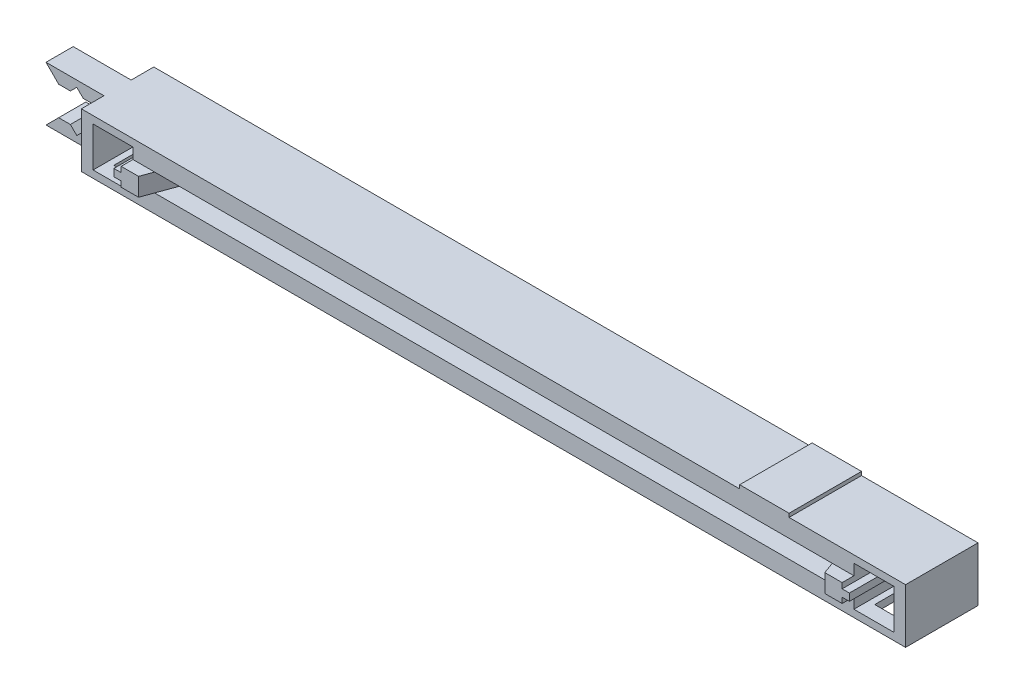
ISO-10303-21;
HEADER;
FILE_DESCRIPTION(('STEP AP214'),'2;1');
FILE_NAME('part.step','',(''),(''),'','','');
FILE_SCHEMA(('AUTOMOTIVE_DESIGN { 1 0 10303 214 1 1 1 1 }'));
ENDSEC;
DATA;
#1=APPLICATION_CONTEXT('core data for automotive mechanical design processes');
#2=APPLICATION_PROTOCOL_DEFINITION('international standard','automotive_design',2000,#1);
#3=PRODUCT_CONTEXT('',#1,'mechanical');
#4=PRODUCT('Part','Part','',(#3));
#5=PRODUCT_RELATED_PRODUCT_CATEGORY('part','',(#4));
#6=PRODUCT_DEFINITION_FORMATION('','',#4);
#7=PRODUCT_DEFINITION_CONTEXT('part definition',#1,'design');
#8=PRODUCT_DEFINITION('design','',#6,#7);
#9=PRODUCT_DEFINITION_SHAPE('','',#8);
#10=(LENGTH_UNIT() NAMED_UNIT(*) SI_UNIT(.MILLI.,.METRE.));
#11=(NAMED_UNIT(*) PLANE_ANGLE_UNIT() SI_UNIT($,.RADIAN.));
#12=(NAMED_UNIT(*) SI_UNIT($,.STERADIAN.) SOLID_ANGLE_UNIT());
#13=UNCERTAINTY_MEASURE_WITH_UNIT(LENGTH_MEASURE(1.E-05),#10,'distance_accuracy_value','');
#14=(GEOMETRIC_REPRESENTATION_CONTEXT(3) GLOBAL_UNCERTAINTY_ASSIGNED_CONTEXT((#13)) GLOBAL_UNIT_ASSIGNED_CONTEXT((#10,
#11,#12)) REPRESENTATION_CONTEXT('',''));
#15=CARTESIAN_POINT('',(0.,0.,0.));
#16=DIRECTION('',(0.,0.,1.));
#17=DIRECTION('',(1.,0.,0.));
#18=AXIS2_PLACEMENT_3D('',#15,#16,#17);
#19=CARTESIAN_POINT('',(17.5,15.,20.));
#20=DIRECTION('',(0.,-1.,0.));
#21=DIRECTION('',(1.,0.,0.));
#22=AXIS2_PLACEMENT_3D('',#19,#20,#21);
#23=PLANE('',#22);
#24=DIRECTION('',(0.,0.,-1.));
#25=VECTOR('',#24,1.);
#26=CARTESIAN_POINT('',(17.5,15.,20.));
#27=LINE('',#26,#25);
#28=CARTESIAN_POINT('',(17.5,15.,20.));
#29=VERTEX_POINT('',#28);
#30=CARTESIAN_POINT('',(17.5,15.,-20.));
#31=VERTEX_POINT('',#30);
#32=EDGE_CURVE('E1234',#29,#31,#27,.T.);
#33=ORIENTED_EDGE('',*,*,#32,.T.);
#34=DIRECTION('',(-1.,0.,0.));
#35=VECTOR('',#34,1.);
#36=CARTESIAN_POINT('',(17.5,15.,-20.));
#37=LINE('',#36,#35);
#38=CARTESIAN_POINT('',(-46.8036409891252,15.,-20.));
#39=VERTEX_POINT('',#38);
#40=EDGE_CURVE('E1229',#31,#39,#37,.T.);
#41=ORIENTED_EDGE('',*,*,#40,.T.);
#42=DIRECTION('',(0.,0.,-1.));
#43=VECTOR('',#42,1.);
#44=CARTESIAN_POINT('',(-46.8036409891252,15.,-20.));
#45=LINE('',#44,#43);
#46=CARTESIAN_POINT('',(-46.8036409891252,15.,20.));
#47=VERTEX_POINT('',#46);
#48=EDGE_CURVE('E55',#47,#39,#45,.T.);
#49=ORIENTED_EDGE('',*,*,#48,.F.);
#50=DIRECTION('',(-1.,0.,0.));
#51=VECTOR('',#50,1.);
#52=CARTESIAN_POINT('',(17.5,15.,20.));
#53=LINE('',#52,#51);
#54=EDGE_CURVE('E1232',#29,#47,#53,.T.);
#55=ORIENTED_EDGE('',*,*,#54,.F.);
#56=EDGE_LOOP('',(#33,#41,#49,#55));
#57=FACE_BOUND('',#56,.T.);
#58=ADVANCED_FACE('F39',(#57),#23,.F.);
#59=DIRECTION('',(0.,0.,1.));
#60=VECTOR('',#59,1.);
#61=CARTESIAN_POINT('',(-74.0587840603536,15.,-20.));
#62=LINE('',#61,#60);
#63=CARTESIAN_POINT('',(-74.0587840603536,15.,-20.));
#64=VERTEX_POINT('',#63);
#65=CARTESIAN_POINT('',(-74.0587840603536,15.,20.));
#66=VERTEX_POINT('',#65);
#67=EDGE_CURVE('E63',#64,#66,#62,.T.);
#68=ORIENTED_EDGE('',*,*,#67,.F.);
#69=CARTESIAN_POINT('',(-437.5,14.9999999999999,-20.));
#70=VERTEX_POINT('',#69);
#71=EDGE_CURVE('E1240',#64,#70,#37,.T.);
#72=ORIENTED_EDGE('',*,*,#71,.T.);
#73=DIRECTION('',(0.,0.,-1.));
#74=VECTOR('',#73,1.);
#75=CARTESIAN_POINT('',(-437.5,14.9999999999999,20.));
#76=LINE('',#75,#74);
#77=CARTESIAN_POINT('',(-437.5,14.9999999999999,-7.5));
#78=VERTEX_POINT('',#77);
#79=EDGE_CURVE('E1185',#78,#70,#76,.T.);
#80=ORIENTED_EDGE('',*,*,#79,.F.);
#81=DIRECTION('',(-1.,0.,0.));
#82=VECTOR('',#81,1.);
#83=CARTESIAN_POINT('',(-437.5,14.9999999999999,-7.5));
#84=LINE('',#83,#82);
#85=CARTESIAN_POINT('',(-469.5,15.,-7.5));
#86=VERTEX_POINT('',#85);
#87=EDGE_CURVE('E854',#78,#86,#84,.T.);
#88=ORIENTED_EDGE('',*,*,#87,.T.);
#89=DIRECTION('',(0.,0.,-1.));
#90=VECTOR('',#89,1.);
#91=CARTESIAN_POINT('',(-469.5,15.,7.5));
#92=LINE('',#91,#90);
#93=CARTESIAN_POINT('',(-469.5,15.,7.5));
#94=VERTEX_POINT('',#93);
#95=EDGE_CURVE('E884',#94,#86,#92,.T.);
#96=ORIENTED_EDGE('',*,*,#95,.F.);
#97=DIRECTION('',(-1.,0.,0.));
#98=VECTOR('',#97,1.);
#99=CARTESIAN_POINT('',(-437.5,14.9999999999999,7.5));
#100=LINE('',#99,#98);
#101=CARTESIAN_POINT('',(-437.5,14.9999999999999,7.5));
#102=VERTEX_POINT('',#101);
#103=EDGE_CURVE('E834',#102,#94,#100,.T.);
#104=ORIENTED_EDGE('',*,*,#103,.F.);
#105=CARTESIAN_POINT('',(-437.5,14.9999999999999,20.));
#106=VERTEX_POINT('',#105);
#107=EDGE_CURVE('E1192',#106,#102,#76,.T.);
#108=ORIENTED_EDGE('',*,*,#107,.F.);
#109=EDGE_CURVE('E1231',#66,#106,#53,.T.);
#110=ORIENTED_EDGE('',*,*,#109,.F.);
#111=EDGE_LOOP('',(#68,#72,#80,#88,#96,#104,#108,#110));
#112=FACE_BOUND('',#111,.T.);
#113=ADVANCED_FACE('F1301',(#112),#23,.F.);
#114=CARTESIAN_POINT('',(-402.5,7.49999999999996,7.5));
#115=DIRECTION('',(0.,0.,-1.));
#116=DIRECTION('',(0.,1.,0.));
#117=AXIS2_PLACEMENT_3D('',#114,#115,#116);
#118=PLANE('',#117);
#119=DIRECTION('',(1.,0.,0.));
#120=VECTOR('',#119,1.);
#121=CARTESIAN_POINT('',(-443.731056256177,5.00000000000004,7.5));
#122=LINE('',#121,#120);
#123=CARTESIAN_POINT('',(-392.5,5.,7.5));
#124=VERTEX_POINT('',#123);
#125=CARTESIAN_POINT('',(-27.5,5.,7.5));
#126=VERTEX_POINT('',#125);
#127=EDGE_CURVE('E688',#124,#126,#122,.T.);
#128=ORIENTED_EDGE('',*,*,#127,.F.);
#129=DIRECTION('',(0.,-1.,0.));
#130=VECTOR('',#129,1.);
#131=CARTESIAN_POINT('',(-392.5,5.,7.5));
#132=LINE('',#131,#130);
#133=CARTESIAN_POINT('',(-392.5,-4.99999999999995,7.5));
#134=VERTEX_POINT('',#133);
#135=EDGE_CURVE('E1052',#124,#134,#132,.T.);
#136=ORIENTED_EDGE('',*,*,#135,.T.);
#137=DIRECTION('',(1.,0.,0.));
#138=VECTOR('',#137,1.);
#139=CARTESIAN_POINT('',(-443.731056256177,-4.99999999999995,7.5));
#140=LINE('',#139,#138);
#141=CARTESIAN_POINT('',(-27.5,-4.99999999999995,7.5));
#142=VERTEX_POINT('',#141);
#143=EDGE_CURVE('E741',#134,#142,#140,.T.);
#144=ORIENTED_EDGE('',*,*,#143,.T.);
#145=DIRECTION('',(0.,-1.,0.));
#146=VECTOR('',#145,1.);
#147=CARTESIAN_POINT('',(-27.5,5.00000000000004,7.5));
#148=LINE('',#147,#146);
#149=EDGE_CURVE('E981',#126,#142,#148,.T.);
#150=ORIENTED_EDGE('',*,*,#149,.F.);
#151=EDGE_LOOP('',(#128,#136,#144,#150));
#152=FACE_BOUND('',#151,.T.);
#153=ADVANCED_FACE('F1306',(#152),#118,.F.);
#154=CARTESIAN_POINT('',(0.,5.,0.));
#155=DIRECTION('',(0.,-1.,0.));
#156=DIRECTION('',(0.,0.,-1.));
#157=AXIS2_PLACEMENT_3D('',#154,#155,#156);
#158=PLANE('',#157);
#159=DIRECTION('',(1.,0.,0.));
#160=VECTOR('',#159,1.);
#161=CARTESIAN_POINT('',(-409.,5.,-20.));
#162=LINE('',#161,#160);
#163=CARTESIAN_POINT('',(-409.,5.,-20.));
#164=VERTEX_POINT('',#163);
#165=CARTESIAN_POINT('',(-397.049627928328,5.00000000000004,-20.));
#166=VERTEX_POINT('',#165);
#167=EDGE_CURVE('E1080',#164,#166,#162,.T.);
#168=ORIENTED_EDGE('',*,*,#167,.T.);
#169=DIRECTION('',(-0.342020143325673,0.,-0.939692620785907));
#170=VECTOR('',#169,1.);
#171=CARTESIAN_POINT('',(-392.5,5.,-7.5));
#172=LINE('',#171,#170);
#173=CARTESIAN_POINT('',(-399.415434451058,5.,-26.5));
#174=VERTEX_POINT('',#173);
#175=EDGE_CURVE('E1075',#166,#174,#172,.T.);
#176=ORIENTED_EDGE('',*,*,#175,.T.);
#177=DIRECTION('',(-1.,0.,0.));
#178=VECTOR('',#177,1.);
#179=CARTESIAN_POINT('',(-399.415434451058,5.,-26.5));
#180=LINE('',#179,#178);
#181=CARTESIAN_POINT('',(-409.,5.,-26.5));
#182=VERTEX_POINT('',#181);
#183=EDGE_CURVE('E1074',#174,#182,#180,.T.);
#184=ORIENTED_EDGE('',*,*,#183,.T.);
#185=DIRECTION('',(0.,0.,1.));
#186=VECTOR('',#185,1.);
#187=CARTESIAN_POINT('',(-409.,5.,-26.5));
#188=LINE('',#187,#186);
#189=EDGE_CURVE('E1077',#182,#164,#188,.T.);
#190=ORIENTED_EDGE('',*,*,#189,.T.);
#191=EDGE_LOOP('',(#168,#176,#184,#190));
#192=FACE_BOUND('',#191,.T.);
#193=ADVANCED_FACE('F1483',(#192),#158,.F.);
#194=CARTESIAN_POINT('',(0.,5.,0.));
#195=DIRECTION('',(0.,-1.,0.));
#196=DIRECTION('',(0.,0.,1.));
#197=AXIS2_PLACEMENT_3D('',#194,#195,#196);
#198=PLANE('',#197);
#199=DIRECTION('',(-0.342020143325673,0.,0.939692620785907));
#200=VECTOR('',#199,1.);
#201=CARTESIAN_POINT('',(-392.5,5.,7.5));
#202=LINE('',#201,#200);
#203=CARTESIAN_POINT('',(-397.049627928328,5.00000000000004,20.));
#204=VERTEX_POINT('',#203);
#205=CARTESIAN_POINT('',(-399.415434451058,5.,26.5));
#206=VERTEX_POINT('',#205);
#207=EDGE_CURVE('E1049',#204,#206,#202,.T.);
#208=ORIENTED_EDGE('',*,*,#207,.F.);
#209=DIRECTION('',(1.,0.,0.));
#210=VECTOR('',#209,1.);
#211=CARTESIAN_POINT('',(-409.,5.,20.));
#212=LINE('',#211,#210);
#213=CARTESIAN_POINT('',(-409.,5.,20.));
#214=VERTEX_POINT('',#213);
#215=EDGE_CURVE('E1040',#214,#204,#212,.T.);
#216=ORIENTED_EDGE('',*,*,#215,.F.);
#217=DIRECTION('',(0.,0.,-1.));
#218=VECTOR('',#217,1.);
#219=CARTESIAN_POINT('',(-409.,5.,26.5));
#220=LINE('',#219,#218);
#221=CARTESIAN_POINT('',(-409.,5.,26.5));
#222=VERTEX_POINT('',#221);
#223=EDGE_CURVE('E1043',#222,#214,#220,.T.);
#224=ORIENTED_EDGE('',*,*,#223,.F.);
#225=DIRECTION('',(-1.,0.,0.));
#226=VECTOR('',#225,1.);
#227=CARTESIAN_POINT('',(-399.415434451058,5.,26.5));
#228=LINE('',#227,#226);
#229=EDGE_CURVE('E1046',#206,#222,#228,.T.);
#230=ORIENTED_EDGE('',*,*,#229,.F.);
#231=EDGE_LOOP('',(#208,#216,#224,#230));
#232=FACE_BOUND('',#231,.T.);
#233=ADVANCED_FACE('F1459',(#232),#198,.F.);
#234=CARTESIAN_POINT('',(-420.,4.99999999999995,0.));
#235=DIRECTION('',(0.,-1.,0.));
#236=DIRECTION('',(0.,0.,-1.));
#237=AXIS2_PLACEMENT_3D('',#234,#235,#236);
#238=PLANE('',#237);
#239=DIRECTION('',(0.342020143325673,0.,-0.939692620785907));
#240=VECTOR('',#239,1.);
#241=CARTESIAN_POINT('',(-27.5,5.00000000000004,-7.5));
#242=LINE('',#241,#240);
#243=CARTESIAN_POINT('',(-22.9503720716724,5.00000000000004,-20.));
#244=VERTEX_POINT('',#243);
#245=CARTESIAN_POINT('',(-20.584565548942,5.00000000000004,-26.5));
#246=VERTEX_POINT('',#245);
#247=EDGE_CURVE('E995',#244,#246,#242,.T.);
#248=ORIENTED_EDGE('',*,*,#247,.F.);
#249=DIRECTION('',(-1.,0.,0.));
#250=VECTOR('',#249,1.);
#251=CARTESIAN_POINT('',(-11.,5.00000000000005,-20.));
#252=LINE('',#251,#250);
#253=CARTESIAN_POINT('',(-11.,5.00000000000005,-20.));
#254=VERTEX_POINT('',#253);
#255=EDGE_CURVE('E985',#254,#244,#252,.T.);
#256=ORIENTED_EDGE('',*,*,#255,.F.);
#257=DIRECTION('',(0.,0.,1.));
#258=VECTOR('',#257,1.);
#259=CARTESIAN_POINT('',(-11.,5.00000000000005,-26.5));
#260=LINE('',#259,#258);
#261=CARTESIAN_POINT('',(-11.,5.00000000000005,-26.5));
#262=VERTEX_POINT('',#261);
#263=EDGE_CURVE('E988',#262,#254,#260,.T.);
#264=ORIENTED_EDGE('',*,*,#263,.F.);
#265=DIRECTION('',(1.,0.,0.));
#266=VECTOR('',#265,1.);
#267=CARTESIAN_POINT('',(-20.584565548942,5.00000000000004,-26.5));
#268=LINE('',#267,#266);
#269=EDGE_CURVE('E992',#246,#262,#268,.T.);
#270=ORIENTED_EDGE('',*,*,#269,.F.);
#271=EDGE_LOOP('',(#248,#256,#264,#270));
#272=FACE_BOUND('',#271,.T.);
#273=ADVANCED_FACE('F1442',(#272),#238,.F.);
#274=CARTESIAN_POINT('',(-420.,4.99999999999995,0.));
#275=DIRECTION('',(0.,-1.,0.));
#276=DIRECTION('',(0.,0.,1.));
#277=AXIS2_PLACEMENT_3D('',#274,#275,#276);
#278=PLANE('',#277);
#279=DIRECTION('',(-1.,0.,0.));
#280=VECTOR('',#279,1.);
#281=CARTESIAN_POINT('',(-11.,5.00000000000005,20.));
#282=LINE('',#281,#280);
#283=CARTESIAN_POINT('',(-11.,5.00000000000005,20.));
#284=VERTEX_POINT('',#283);
#285=CARTESIAN_POINT('',(-22.9503720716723,5.00000000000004,20.));
#286=VERTEX_POINT('',#285);
#287=EDGE_CURVE('E960',#284,#286,#282,.T.);
#288=ORIENTED_EDGE('',*,*,#287,.T.);
#289=DIRECTION('',(0.342020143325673,0.,0.939692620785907));
#290=VECTOR('',#289,1.);
#291=CARTESIAN_POINT('',(-27.5,5.00000000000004,7.5));
#292=LINE('',#291,#290);
#293=CARTESIAN_POINT('',(-20.584565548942,5.00000000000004,26.5));
#294=VERTEX_POINT('',#293);
#295=EDGE_CURVE('E956',#286,#294,#292,.T.);
#296=ORIENTED_EDGE('',*,*,#295,.T.);
#297=DIRECTION('',(1.,0.,0.));
#298=VECTOR('',#297,1.);
#299=CARTESIAN_POINT('',(-20.584565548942,5.00000000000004,26.5));
#300=LINE('',#299,#298);
#301=CARTESIAN_POINT('',(-11.,5.00000000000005,26.5));
#302=VERTEX_POINT('',#301);
#303=EDGE_CURVE('E955',#294,#302,#300,.T.);
#304=ORIENTED_EDGE('',*,*,#303,.T.);
#305=DIRECTION('',(0.,0.,-1.));
#306=VECTOR('',#305,1.);
#307=CARTESIAN_POINT('',(-11.,5.00000000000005,26.5));
#308=LINE('',#307,#306);
#309=EDGE_CURVE('E958',#302,#284,#308,.T.);
#310=ORIENTED_EDGE('',*,*,#309,.T.);
#311=EDGE_LOOP('',(#288,#296,#304,#310));
#312=FACE_BOUND('',#311,.T.);
#313=ADVANCED_FACE('F1439',(#312),#278,.F.);
#314=CARTESIAN_POINT('',(-402.5,7.49999999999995,-7.5));
#315=DIRECTION('',(0.,0.,1.));
#316=DIRECTION('',(0.,-1.,0.));
#317=AXIS2_PLACEMENT_3D('',#314,#315,#316);
#318=PLANE('',#317);
#319=DIRECTION('',(0.,-1.,0.));
#320=VECTOR('',#319,1.);
#321=CARTESIAN_POINT('',(-392.5,5.,-7.5));
#322=LINE('',#321,#320);
#323=CARTESIAN_POINT('',(-392.5,5.00000000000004,-7.5));
#324=VERTEX_POINT('',#323);
#325=CARTESIAN_POINT('',(-392.5,-5.,-7.5));
#326=VERTEX_POINT('',#325);
#327=EDGE_CURVE('E1100',#324,#326,#322,.T.);
#328=ORIENTED_EDGE('',*,*,#327,.F.);
#329=DIRECTION('',(1.,0.,0.));
#330=VECTOR('',#329,1.);
#331=CARTESIAN_POINT('',(-443.731056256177,5.00000000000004,-7.5));
#332=LINE('',#331,#330);
#333=CARTESIAN_POINT('',(-27.5,5.00000000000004,-7.5));
#334=VERTEX_POINT('',#333);
#335=EDGE_CURVE('E675',#324,#334,#332,.T.);
#336=ORIENTED_EDGE('',*,*,#335,.T.);
#337=DIRECTION('',(0.,-1.,0.));
#338=VECTOR('',#337,1.);
#339=CARTESIAN_POINT('',(-27.5,5.00000000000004,-7.5));
#340=LINE('',#339,#338);
#341=CARTESIAN_POINT('',(-27.5,-5.,-7.5));
#342=VERTEX_POINT('',#341);
#343=EDGE_CURVE('E998',#334,#342,#340,.T.);
#344=ORIENTED_EDGE('',*,*,#343,.T.);
#345=DIRECTION('',(1.,0.,0.));
#346=VECTOR('',#345,1.);
#347=CARTESIAN_POINT('',(-443.731056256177,-4.99999999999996,-7.5));
#348=LINE('',#347,#346);
#349=EDGE_CURVE('E730',#326,#342,#348,.T.);
#350=ORIENTED_EDGE('',*,*,#349,.F.);
#351=EDGE_LOOP('',(#328,#336,#344,#350));
#352=FACE_BOUND('',#351,.T.);
#353=ADVANCED_FACE('F1308',(#352),#318,.F.);
#354=CARTESIAN_POINT('',(0.,-5.,0.));
#355=DIRECTION('',(0.,-1.,0.));
#356=DIRECTION('',(0.,0.,-1.));
#357=AXIS2_PLACEMENT_3D('',#354,#355,#356);
#358=PLANE('',#357);
#359=DIRECTION('',(-0.342020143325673,0.,-0.939692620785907));
#360=VECTOR('',#359,1.);
#361=CARTESIAN_POINT('',(-392.5,-5.,-7.5));
#362=LINE('',#361,#360);
#363=CARTESIAN_POINT('',(-397.049627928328,-4.99999999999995,-20.));
#364=VERTEX_POINT('',#363);
#365=CARTESIAN_POINT('',(-399.415434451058,-5.,-26.5));
#366=VERTEX_POINT('',#365);
#367=EDGE_CURVE('E1071',#364,#366,#362,.T.);
#368=ORIENTED_EDGE('',*,*,#367,.F.);
#369=DIRECTION('',(1.,0.,0.));
#370=VECTOR('',#369,1.);
#371=CARTESIAN_POINT('',(-409.,-5.,-20.));
#372=LINE('',#371,#370);
#373=CARTESIAN_POINT('',(-409.,-5.,-20.));
#374=VERTEX_POINT('',#373);
#375=EDGE_CURVE('E1092',#374,#364,#372,.T.);
#376=ORIENTED_EDGE('',*,*,#375,.F.);
#377=DIRECTION('',(0.,0.,1.));
#378=VECTOR('',#377,1.);
#379=CARTESIAN_POINT('',(-409.,-5.,-26.5));
#380=LINE('',#379,#378);
#381=CARTESIAN_POINT('',(-409.,-5.,-26.5));
#382=VERTEX_POINT('',#381);
#383=EDGE_CURVE('E1089',#382,#374,#380,.T.);
#384=ORIENTED_EDGE('',*,*,#383,.F.);
#385=DIRECTION('',(-1.,0.,0.));
#386=VECTOR('',#385,1.);
#387=CARTESIAN_POINT('',(-399.415434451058,-5.,-26.5));
#388=LINE('',#387,#386);
#389=EDGE_CURVE('E1086',#366,#382,#388,.T.);
#390=ORIENTED_EDGE('',*,*,#389,.F.);
#391=EDGE_LOOP('',(#368,#376,#384,#390));
#392=FACE_BOUND('',#391,.T.);
#393=ADVANCED_FACE('F1487',(#392),#358,.T.);
#394=CARTESIAN_POINT('',(0.,-5.,0.));
#395=DIRECTION('',(0.,-1.,0.));
#396=DIRECTION('',(0.,0.,1.));
#397=AXIS2_PLACEMENT_3D('',#394,#395,#396);
#398=PLANE('',#397);
#399=DIRECTION('',(1.,0.,0.));
#400=VECTOR('',#399,1.);
#401=CARTESIAN_POINT('',(-409.,-5.,20.));
#402=LINE('',#401,#400);
#403=CARTESIAN_POINT('',(-409.,-5.,20.));
#404=VERTEX_POINT('',#403);
#405=CARTESIAN_POINT('',(-397.049627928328,-4.99999999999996,20.));
#406=VERTEX_POINT('',#405);
#407=EDGE_CURVE('E1033',#404,#406,#402,.T.);
#408=ORIENTED_EDGE('',*,*,#407,.T.);
#409=DIRECTION('',(-0.342020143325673,0.,0.939692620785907));
#410=VECTOR('',#409,1.);
#411=CARTESIAN_POINT('',(-392.5,-5.,7.5));
#412=LINE('',#411,#410);
#413=CARTESIAN_POINT('',(-399.415434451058,-5.,26.5));
#414=VERTEX_POINT('',#413);
#415=EDGE_CURVE('E1060',#406,#414,#412,.T.);
#416=ORIENTED_EDGE('',*,*,#415,.T.);
#417=DIRECTION('',(-1.,0.,0.));
#418=VECTOR('',#417,1.);
#419=CARTESIAN_POINT('',(-399.415434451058,-5.,26.5));
#420=LINE('',#419,#418);
#421=CARTESIAN_POINT('',(-409.,-5.,26.5));
#422=VERTEX_POINT('',#421);
#423=EDGE_CURVE('E1057',#414,#422,#420,.T.);
#424=ORIENTED_EDGE('',*,*,#423,.T.);
#425=DIRECTION('',(0.,0.,-1.));
#426=VECTOR('',#425,1.);
#427=CARTESIAN_POINT('',(-409.,-5.,26.5));
#428=LINE('',#427,#426);
#429=EDGE_CURVE('E1055',#422,#404,#428,.T.);
#430=ORIENTED_EDGE('',*,*,#429,.T.);
#431=EDGE_LOOP('',(#408,#416,#424,#430));
#432=FACE_BOUND('',#431,.T.);
#433=ADVANCED_FACE('F1463',(#432),#398,.T.);
#434=CARTESIAN_POINT('',(-420.,-5.00000000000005,0.));
#435=DIRECTION('',(0.,-1.,0.));
#436=DIRECTION('',(0.,0.,-1.));
#437=AXIS2_PLACEMENT_3D('',#434,#435,#436);
#438=PLANE('',#437);
#439=DIRECTION('',(-1.,0.,0.));
#440=VECTOR('',#439,1.);
#441=CARTESIAN_POINT('',(-11.,-4.99999999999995,-20.));
#442=LINE('',#441,#440);
#443=CARTESIAN_POINT('',(-11.,-4.99999999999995,-20.));
#444=VERTEX_POINT('',#443);
#445=CARTESIAN_POINT('',(-22.9503720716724,-4.99999999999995,-20.));
#446=VERTEX_POINT('',#445);
#447=EDGE_CURVE('E984',#444,#446,#442,.T.);
#448=ORIENTED_EDGE('',*,*,#447,.T.);
#449=DIRECTION('',(0.342020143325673,0.,-0.939692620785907));
#450=VECTOR('',#449,1.);
#451=CARTESIAN_POINT('',(-27.5,-4.99999999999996,-7.5));
#452=LINE('',#451,#450);
#453=CARTESIAN_POINT('',(-20.584565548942,-4.99999999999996,-26.5));
#454=VERTEX_POINT('',#453);
#455=EDGE_CURVE('E1007',#446,#454,#452,.T.);
#456=ORIENTED_EDGE('',*,*,#455,.T.);
#457=DIRECTION('',(1.,0.,0.));
#458=VECTOR('',#457,1.);
#459=CARTESIAN_POINT('',(-20.584565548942,-4.99999999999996,-26.5));
#460=LINE('',#459,#458);
#461=CARTESIAN_POINT('',(-11.,-4.99999999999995,-26.5));
#462=VERTEX_POINT('',#461);
#463=EDGE_CURVE('E1004',#454,#462,#460,.T.);
#464=ORIENTED_EDGE('',*,*,#463,.T.);
#465=DIRECTION('',(0.,0.,1.));
#466=VECTOR('',#465,1.);
#467=CARTESIAN_POINT('',(-11.,-4.99999999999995,-26.5));
#468=LINE('',#467,#466);
#469=EDGE_CURVE('E1001',#462,#444,#468,.T.);
#470=ORIENTED_EDGE('',*,*,#469,.T.);
#471=EDGE_LOOP('',(#448,#456,#464,#470));
#472=FACE_BOUND('',#471,.T.);
#473=ADVANCED_FACE('F1447',(#472),#438,.T.);
#474=CARTESIAN_POINT('',(-420.,-5.00000000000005,0.));
#475=DIRECTION('',(0.,-1.,0.));
#476=DIRECTION('',(0.,0.,1.));
#477=AXIS2_PLACEMENT_3D('',#474,#475,#476);
#478=PLANE('',#477);
#479=DIRECTION('',(0.342020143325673,0.,0.939692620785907));
#480=VECTOR('',#479,1.);
#481=CARTESIAN_POINT('',(-27.5,-4.99999999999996,7.5));
#482=LINE('',#481,#480);
#483=CARTESIAN_POINT('',(-22.9503720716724,-4.99999999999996,20.));
#484=VERTEX_POINT('',#483);
#485=CARTESIAN_POINT('',(-20.584565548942,-4.99999999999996,26.5));
#486=VERTEX_POINT('',#485);
#487=EDGE_CURVE('E952',#484,#486,#482,.T.);
#488=ORIENTED_EDGE('',*,*,#487,.F.);
#489=DIRECTION('',(-1.,0.,0.));
#490=VECTOR('',#489,1.);
#491=CARTESIAN_POINT('',(-11.,-4.99999999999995,20.));
#492=LINE('',#491,#490);
#493=CARTESIAN_POINT('',(-11.,-4.99999999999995,20.));
#494=VERTEX_POINT('',#493);
#495=EDGE_CURVE('E972',#494,#484,#492,.T.);
#496=ORIENTED_EDGE('',*,*,#495,.F.);
#497=DIRECTION('',(0.,0.,-1.));
#498=VECTOR('',#497,1.);
#499=CARTESIAN_POINT('',(-11.,-4.99999999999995,26.5));
#500=LINE('',#499,#498);
#501=CARTESIAN_POINT('',(-11.,-4.99999999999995,26.5));
#502=VERTEX_POINT('',#501);
#503=EDGE_CURVE('E969',#502,#494,#500,.T.);
#504=ORIENTED_EDGE('',*,*,#503,.F.);
#505=DIRECTION('',(1.,0.,0.));
#506=VECTOR('',#505,1.);
#507=CARTESIAN_POINT('',(-20.584565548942,-4.99999999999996,26.5));
#508=LINE('',#507,#506);
#509=EDGE_CURVE('E966',#486,#502,#508,.T.);
#510=ORIENTED_EDGE('',*,*,#509,.F.);
#511=EDGE_LOOP('',(#488,#496,#504,#510));
#512=FACE_BOUND('',#511,.T.);
#513=ADVANCED_FACE('F1444',(#512),#478,.T.);
#514=CARTESIAN_POINT('',(-11.,11.,-20.));
#515=DIRECTION('',(-1.,0.,0.));
#516=DIRECTION('',(0.,-1.,0.));
#517=AXIS2_PLACEMENT_3D('',#514,#515,#516);
#518=PLANE('',#517);
#519=DIRECTION('',(0.,0.,1.));
#520=VECTOR('',#519,1.);
#521=CARTESIAN_POINT('',(-11.,2.00000000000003,-20.));
#522=LINE('',#521,#520);
#523=CARTESIAN_POINT('',(-11.,2.00000000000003,-26.5));
#524=VERTEX_POINT('',#523);
#525=CARTESIAN_POINT('',(-11.,2.00000000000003,26.5));
#526=VERTEX_POINT('',#525);
#527=EDGE_CURVE('E799',#524,#526,#522,.T.);
#528=ORIENTED_EDGE('',*,*,#527,.F.);
#529=DIRECTION('',(0.,-1.,0.));
#530=VECTOR('',#529,1.);
#531=CARTESIAN_POINT('',(-11.,5.00000000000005,-26.5));
#532=LINE('',#531,#530);
#533=EDGE_CURVE('E1015',#262,#524,#532,.T.);
#534=ORIENTED_EDGE('',*,*,#533,.F.);
#535=ORIENTED_EDGE('',*,*,#263,.T.);
#536=DIRECTION('',(0.,-1.,0.));
#537=VECTOR('',#536,1.);
#538=CARTESIAN_POINT('',(-11.,11.,-20.));
#539=LINE('',#538,#537);
#540=CARTESIAN_POINT('',(-11.,11.,-20.));
#541=VERTEX_POINT('',#540);
#542=EDGE_CURVE('E1158',#541,#254,#539,.T.);
#543=ORIENTED_EDGE('',*,*,#542,.F.);
#544=DIRECTION('',(0.,0.,1.));
#545=VECTOR('',#544,1.);
#546=CARTESIAN_POINT('',(-11.,11.,-20.));
#547=LINE('',#546,#545);
#548=CARTESIAN_POINT('',(-11.,11.,20.));
#549=VERTEX_POINT('',#548);
#550=EDGE_CURVE('E1183',#541,#549,#547,.T.);
#551=ORIENTED_EDGE('',*,*,#550,.T.);
#552=DIRECTION('',(0.,-1.,0.));
#553=VECTOR('',#552,1.);
#554=CARTESIAN_POINT('',(-11.,11.,20.));
#555=LINE('',#554,#553);
#556=EDGE_CURVE('E1171',#549,#284,#555,.T.);
#557=ORIENTED_EDGE('',*,*,#556,.T.);
#558=ORIENTED_EDGE('',*,*,#309,.F.);
#559=DIRECTION('',(0.,-1.,0.));
#560=VECTOR('',#559,1.);
#561=CARTESIAN_POINT('',(-11.,5.00000000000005,26.5));
#562=LINE('',#561,#560);
#563=EDGE_CURVE('E975',#302,#526,#562,.T.);
#564=ORIENTED_EDGE('',*,*,#563,.T.);
#565=EDGE_LOOP('',(#528,#534,#535,#543,#551,#557,#558,#564));
#566=FACE_BOUND('',#565,.T.);
#567=ADVANCED_FACE('F1323',(#566),#518,.F.);
#568=DIRECTION('',(0.,0.,-1.));
#569=VECTOR('',#568,1.);
#570=CARTESIAN_POINT('',(-11.,-1.99999999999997,-20.));
#571=LINE('',#570,#569);
#572=CARTESIAN_POINT('',(-11.,-1.99999999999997,26.5));
#573=VERTEX_POINT('',#572);
#574=CARTESIAN_POINT('',(-11.,-1.99999999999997,-26.5));
#575=VERTEX_POINT('',#574);
#576=EDGE_CURVE('E784',#573,#575,#571,.T.);
#577=ORIENTED_EDGE('',*,*,#576,.F.);
#578=EDGE_CURVE('E963',#573,#502,#562,.T.);
#579=ORIENTED_EDGE('',*,*,#578,.T.);
#580=ORIENTED_EDGE('',*,*,#503,.T.);
#581=CARTESIAN_POINT('',(-11.,-11.,20.));
#582=VERTEX_POINT('',#581);
#583=EDGE_CURVE('E1150',#494,#582,#555,.T.);
#584=ORIENTED_EDGE('',*,*,#583,.T.);
#585=DIRECTION('',(0.,0.,1.));
#586=VECTOR('',#585,1.);
#587=CARTESIAN_POINT('',(-11.,-11.,-20.));
#588=LINE('',#587,#586);
#589=CARTESIAN_POINT('',(-11.,-11.,-20.));
#590=VERTEX_POINT('',#589);
#591=EDGE_CURVE('E1170',#590,#582,#588,.T.);
#592=ORIENTED_EDGE('',*,*,#591,.F.);
#593=EDGE_CURVE('E1161',#444,#590,#539,.T.);
#594=ORIENTED_EDGE('',*,*,#593,.F.);
#595=ORIENTED_EDGE('',*,*,#469,.F.);
#596=EDGE_CURVE('E1014',#575,#462,#532,.T.);
#597=ORIENTED_EDGE('',*,*,#596,.F.);
#598=EDGE_LOOP('',(#577,#579,#580,#584,#592,#594,#595,#597));
#599=FACE_BOUND('',#598,.T.);
#600=ADVANCED_FACE('F1313',(#599),#518,.F.);
#601=CARTESIAN_POINT('',(17.5,15.,20.));
#602=DIRECTION('',(-1.,0.,0.));
#603=DIRECTION('',(0.,-1.,0.));
#604=AXIS2_PLACEMENT_3D('',#601,#602,#603);
#605=PLANE('',#604);
#606=DIRECTION('',(0.,0.,-1.));
#607=VECTOR('',#606,1.);
#608=CARTESIAN_POINT('',(17.5,-15.,20.));
#609=LINE('',#608,#607);
#610=CARTESIAN_POINT('',(17.5,-15.,20.));
#611=VERTEX_POINT('',#610);
#612=CARTESIAN_POINT('',(17.5,-15.,-20.));
#613=VERTEX_POINT('',#612);
#614=EDGE_CURVE('E1243',#611,#613,#609,.T.);
#615=ORIENTED_EDGE('',*,*,#614,.T.);
#616=DIRECTION('',(0.,1.,0.));
#617=VECTOR('',#616,1.);
#618=CARTESIAN_POINT('',(17.5,15.,-20.));
#619=LINE('',#618,#617);
#620=EDGE_CURVE('E1237',#613,#31,#619,.T.);
#621=ORIENTED_EDGE('',*,*,#620,.T.);
#622=ORIENTED_EDGE('',*,*,#32,.F.);
#623=DIRECTION('',(0.,1.,0.));
#624=VECTOR('',#623,1.);
#625=CARTESIAN_POINT('',(17.5,15.,20.));
#626=LINE('',#625,#624);
#627=EDGE_CURVE('E1228',#611,#29,#626,.T.);
#628=ORIENTED_EDGE('',*,*,#627,.F.);
#629=EDGE_LOOP('',(#615,#621,#622,#628));
#630=FACE_BOUND('',#629,.T.);
#631=ADVANCED_FACE('F1310',(#630),#605,.F.);
#632=CARTESIAN_POINT('',(-409.,10.9999999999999,-20.));
#633=DIRECTION('',(1.,0.,0.));
#634=DIRECTION('',(0.,0.,-1.));
#635=AXIS2_PLACEMENT_3D('',#632,#633,#634);
#636=PLANE('',#635);
#637=DIRECTION('',(0.,-1.,0.));
#638=VECTOR('',#637,1.);
#639=CARTESIAN_POINT('',(-409.,5.,-26.5));
#640=LINE('',#639,#638);
#641=CARTESIAN_POINT('',(-409.,1.99999999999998,-26.5));
#642=VERTEX_POINT('',#641);
#643=EDGE_CURVE('E1095',#182,#642,#640,.T.);
#644=ORIENTED_EDGE('',*,*,#643,.T.);
#645=DIRECTION('',(0.,0.,1.));
#646=VECTOR('',#645,1.);
#647=CARTESIAN_POINT('',(-409.,1.99999999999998,-20.));
#648=LINE('',#647,#646);
#649=CARTESIAN_POINT('',(-409.,1.99999999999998,26.5));
#650=VERTEX_POINT('',#649);
#651=EDGE_CURVE('E824',#642,#650,#648,.T.);
#652=ORIENTED_EDGE('',*,*,#651,.T.);
#653=DIRECTION('',(0.,-1.,0.));
#654=VECTOR('',#653,1.);
#655=CARTESIAN_POINT('',(-409.,5.,26.5));
#656=LINE('',#655,#654);
#657=EDGE_CURVE('E1068',#222,#650,#656,.T.);
#658=ORIENTED_EDGE('',*,*,#657,.F.);
#659=ORIENTED_EDGE('',*,*,#223,.T.);
#660=DIRECTION('',(0.,1.,0.));
#661=VECTOR('',#660,1.);
#662=CARTESIAN_POINT('',(-409.,10.9999999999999,20.));
#663=LINE('',#662,#661);
#664=CARTESIAN_POINT('',(-409.,10.9999999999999,20.));
#665=VERTEX_POINT('',#664);
#666=EDGE_CURVE('E1142',#214,#665,#663,.T.);
#667=ORIENTED_EDGE('',*,*,#666,.T.);
#668=DIRECTION('',(0.,0.,1.));
#669=VECTOR('',#668,1.);
#670=CARTESIAN_POINT('',(-409.,10.9999999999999,-20.));
#671=LINE('',#670,#669);
#672=CARTESIAN_POINT('',(-409.,10.9999999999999,-20.));
#673=VERTEX_POINT('',#672);
#674=EDGE_CURVE('E1151',#673,#665,#671,.T.);
#675=ORIENTED_EDGE('',*,*,#674,.F.);
#676=DIRECTION('',(0.,1.,0.));
#677=VECTOR('',#676,1.);
#678=CARTESIAN_POINT('',(-409.,10.9999999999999,-20.));
#679=LINE('',#678,#677);
#680=EDGE_CURVE('E1131',#164,#673,#679,.T.);
#681=ORIENTED_EDGE('',*,*,#680,.F.);
#682=ORIENTED_EDGE('',*,*,#189,.F.);
#683=EDGE_LOOP('',(#644,#652,#658,#659,#667,#675,#681,#682));
#684=FACE_BOUND('',#683,.T.);
#685=ADVANCED_FACE('F1312',(#684),#636,.F.);
#686=CARTESIAN_POINT('',(-437.5,0.,0.));
#687=DIRECTION('',(-1.,0.,0.));
#688=DIRECTION('',(0.,0.,1.));
#689=AXIS2_PLACEMENT_3D('',#686,#687,#688);
#690=PLANE('',#689);
#691=DIRECTION('',(0.,1.,0.));
#692=VECTOR('',#691,1.);
#693=CARTESIAN_POINT('',(-437.5,5.00000000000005,7.5));
#694=LINE('',#693,#692);
#695=CARTESIAN_POINT('',(-437.5,5.00000000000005,7.5));
#696=VERTEX_POINT('',#695);
#697=EDGE_CURVE('E830',#696,#102,#694,.T.);
#698=ORIENTED_EDGE('',*,*,#697,.F.);
#699=DIRECTION('',(0.,0.,-1.));
#700=VECTOR('',#699,1.);
#701=CARTESIAN_POINT('',(-437.5,5.00000000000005,7.5));
#702=LINE('',#701,#700);
#703=CARTESIAN_POINT('',(-437.5,5.00000000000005,-7.5));
#704=VERTEX_POINT('',#703);
#705=EDGE_CURVE('E887',#696,#704,#702,.T.);
#706=ORIENTED_EDGE('',*,*,#705,.T.);
#707=DIRECTION('',(0.,1.,0.));
#708=VECTOR('',#707,1.);
#709=CARTESIAN_POINT('',(-437.5,5.00000000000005,-7.5));
#710=LINE('',#709,#708);
#711=EDGE_CURVE('E851',#704,#78,#710,.T.);
#712=ORIENTED_EDGE('',*,*,#711,.T.);
#713=ORIENTED_EDGE('',*,*,#79,.T.);
#714=DIRECTION('',(0.,-1.,0.));
#715=VECTOR('',#714,1.);
#716=CARTESIAN_POINT('',(-437.5,14.9999999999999,-20.));
#717=LINE('',#716,#715);
#718=CARTESIAN_POINT('',(-437.5,-15.,-20.));
#719=VERTEX_POINT('',#718);
#720=EDGE_CURVE('E1194',#70,#719,#717,.T.);
#721=ORIENTED_EDGE('',*,*,#720,.T.);
#722=DIRECTION('',(0.,0.,1.));
#723=VECTOR('',#722,1.);
#724=CARTESIAN_POINT('',(-437.5,-15.,-20.));
#725=LINE('',#724,#723);
#726=CARTESIAN_POINT('',(-437.5,-15.,-7.5));
#727=VERTEX_POINT('',#726);
#728=EDGE_CURVE('E1198',#719,#727,#725,.T.);
#729=ORIENTED_EDGE('',*,*,#728,.T.);
#730=DIRECTION('',(0.,1.,0.));
#731=VECTOR('',#730,1.);
#732=CARTESIAN_POINT('',(-437.5,-5.00000000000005,-7.5));
#733=LINE('',#732,#731);
#734=CARTESIAN_POINT('',(-437.5,-5.00000000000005,-7.5));
#735=VERTEX_POINT('',#734);
#736=EDGE_CURVE('E889',#727,#735,#733,.T.);
#737=ORIENTED_EDGE('',*,*,#736,.T.);
#738=DIRECTION('',(0.,0.,-1.));
#739=VECTOR('',#738,1.);
#740=CARTESIAN_POINT('',(-437.5,-5.00000000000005,7.5));
#741=LINE('',#740,#739);
#742=CARTESIAN_POINT('',(-437.5,-5.00000000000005,7.5));
#743=VERTEX_POINT('',#742);
#744=EDGE_CURVE('E949',#743,#735,#741,.T.);
#745=ORIENTED_EDGE('',*,*,#744,.F.);
#746=DIRECTION('',(0.,1.,0.));
#747=VECTOR('',#746,1.);
#748=CARTESIAN_POINT('',(-437.5,-5.00000000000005,7.5));
#749=LINE('',#748,#747);
#750=CARTESIAN_POINT('',(-437.5,-15.,7.5));
#751=VERTEX_POINT('',#750);
#752=EDGE_CURVE('E890',#751,#743,#749,.T.);
#753=ORIENTED_EDGE('',*,*,#752,.F.);
#754=CARTESIAN_POINT('',(-437.5,-15.,20.));
#755=VERTEX_POINT('',#754);
#756=EDGE_CURVE('E1197',#751,#755,#725,.T.);
#757=ORIENTED_EDGE('',*,*,#756,.T.);
#758=DIRECTION('',(0.,1.,0.));
#759=VECTOR('',#758,1.);
#760=CARTESIAN_POINT('',(-437.5,-15.,20.));
#761=LINE('',#760,#759);
#762=EDGE_CURVE('E1200',#755,#106,#761,.T.);
#763=ORIENTED_EDGE('',*,*,#762,.T.);
#764=ORIENTED_EDGE('',*,*,#107,.T.);
#765=EDGE_LOOP('',(#698,#706,#712,#713,#721,#729,#737,#745,#753,#757,#763,#764));
#766=FACE_BOUND('',#765,.T.);
#767=ADVANCED_FACE('F1319',(#766),#690,.T.);
#768=CARTESIAN_POINT('',(11.,-11.,-20.));
#769=DIRECTION('',(0.,-1.,0.));
#770=DIRECTION('',(1.,0.,0.));
#771=AXIS2_PLACEMENT_3D('',#768,#769,#770);
#772=PLANE('',#771);
#773=DIRECTION('',(1.,0.,0.));
#774=VECTOR('',#773,1.);
#775=CARTESIAN_POINT('',(11.,-11.,20.));
#776=LINE('',#775,#774);
#777=CARTESIAN_POINT('',(11.,-11.,20.));
#778=VERTEX_POINT('',#777);
#779=EDGE_CURVE('E1174',#582,#778,#776,.T.);
#780=ORIENTED_EDGE('',*,*,#779,.T.);
#781=DIRECTION('',(0.,0.,1.));
#782=VECTOR('',#781,1.);
#783=CARTESIAN_POINT('',(11.,-11.,-20.));
#784=LINE('',#783,#782);
#785=CARTESIAN_POINT('',(11.,-11.,-20.));
#786=VERTEX_POINT('',#785);
#787=EDGE_CURVE('E1188',#786,#778,#784,.T.);
#788=ORIENTED_EDGE('',*,*,#787,.F.);
#789=DIRECTION('',(1.,0.,0.));
#790=VECTOR('',#789,1.);
#791=CARTESIAN_POINT('',(11.,-11.,-20.));
#792=LINE('',#791,#790);
#793=EDGE_CURVE('E1160',#590,#786,#792,.T.);
#794=ORIENTED_EDGE('',*,*,#793,.F.);
#795=ORIENTED_EDGE('',*,*,#591,.T.);
#796=EDGE_LOOP('',(#780,#788,#794,#795));
#797=FACE_BOUND('',#796,.T.);
#798=DIRECTION('',(0.,0.,-1.));
#799=VECTOR('',#798,1.);
#800=CARTESIAN_POINT('',(7.50000000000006,-11.,-20.));
#801=LINE('',#800,#799);
#802=CARTESIAN_POINT('',(7.50000000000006,-11.,12.));
#803=VERTEX_POINT('',#802);
#804=CARTESIAN_POINT('',(7.50000000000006,-11.,-12.));
#805=VERTEX_POINT('',#804);
#806=EDGE_CURVE('E11',#803,#805,#801,.T.);
#807=ORIENTED_EDGE('',*,*,#806,.F.);
#808=DIRECTION('',(1.,0.,0.));
#809=VECTOR('',#808,1.);
#810=CARTESIAN_POINT('',(11.,-11.,12.));
#811=LINE('',#810,#809);
#812=CARTESIAN_POINT('',(-7.4999999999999,-11.,12.));
#813=VERTEX_POINT('',#812);
#814=EDGE_CURVE('E1257',#813,#803,#811,.T.);
#815=ORIENTED_EDGE('',*,*,#814,.F.);
#816=DIRECTION('',(0.,0.,1.));
#817=VECTOR('',#816,1.);
#818=CARTESIAN_POINT('',(-7.4999999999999,-11.,-20.));
#819=LINE('',#818,#817);
#820=CARTESIAN_POINT('',(-7.4999999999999,-11.,-12.));
#821=VERTEX_POINT('',#820);
#822=EDGE_CURVE('E1259',#821,#813,#819,.T.);
#823=ORIENTED_EDGE('',*,*,#822,.F.);
#824=DIRECTION('',(-1.,0.,0.));
#825=VECTOR('',#824,1.);
#826=CARTESIAN_POINT('',(11.,-11.,-12.));
#827=LINE('',#826,#825);
#828=EDGE_CURVE('E48',#805,#821,#827,.T.);
#829=ORIENTED_EDGE('',*,*,#828,.F.);
#830=EDGE_LOOP('',(#807,#815,#823,#829));
#831=FACE_BOUND('',#830,.T.);
#832=ADVANCED_FACE('F1274',(#797,#831),#772,.F.);
#833=CARTESIAN_POINT('',(-437.5,-15.,20.));
#834=DIRECTION('',(0.,0.,-1.));
#835=DIRECTION('',(-1.,0.,0.));
#836=AXIS2_PLACEMENT_3D('',#833,#834,#835);
#837=PLANE('',#836);
#838=ORIENTED_EDGE('',*,*,#54,.T.);
#839=DIRECTION('',(0.,-1.,0.));
#840=VECTOR('',#839,1.);
#841=CARTESIAN_POINT('',(-46.8036409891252,17.,20.));
#842=LINE('',#841,#840);
#843=CARTESIAN_POINT('',(-46.8036409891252,17.,20.));
#844=VERTEX_POINT('',#843);
#845=EDGE_CURVE('E1333',#844,#47,#842,.T.);
#846=ORIENTED_EDGE('',*,*,#845,.F.);
#847=DIRECTION('',(1.,0.,0.));
#848=VECTOR('',#847,1.);
#849=CARTESIAN_POINT('',(-46.8036409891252,17.,20.));
#850=LINE('',#849,#848);
#851=CARTESIAN_POINT('',(-74.0587840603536,17.,20.));
#852=VERTEX_POINT('',#851);
#853=EDGE_CURVE('E614',#852,#844,#850,.T.);
#854=ORIENTED_EDGE('',*,*,#853,.F.);
#855=DIRECTION('',(0.,-1.,0.));
#856=VECTOR('',#855,1.);
#857=CARTESIAN_POINT('',(-74.0587840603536,17.,20.));
#858=LINE('',#857,#856);
#859=EDGE_CURVE('E625',#852,#66,#858,.T.);
#860=ORIENTED_EDGE('',*,*,#859,.T.);
#861=ORIENTED_EDGE('',*,*,#109,.T.);
#862=ORIENTED_EDGE('',*,*,#762,.F.);
#863=DIRECTION('',(1.,0.,0.));
#864=VECTOR('',#863,1.);
#865=CARTESIAN_POINT('',(17.5,-15.,20.));
#866=LINE('',#865,#864);
#867=EDGE_CURVE('E1226',#755,#611,#866,.T.);
#868=ORIENTED_EDGE('',*,*,#867,.T.);
#869=ORIENTED_EDGE('',*,*,#627,.T.);
#870=EDGE_LOOP('',(#838,#846,#854,#860,#861,#862,#868,#869));
#871=FACE_BOUND('',#870,.T.);
#872=ORIENTED_EDGE('',*,*,#215,.T.);
#873=DIRECTION('',(1.,0.,0.));
#874=VECTOR('',#873,1.);
#875=CARTESIAN_POINT('',(-443.731056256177,5.00000000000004,20.));
#876=LINE('',#875,#874);
#877=EDGE_CURVE('E697',#204,#286,#876,.T.);
#878=ORIENTED_EDGE('',*,*,#877,.T.);
#879=ORIENTED_EDGE('',*,*,#287,.F.);
#880=ORIENTED_EDGE('',*,*,#556,.F.);
#881=DIRECTION('',(-1.,0.,0.));
#882=VECTOR('',#881,1.);
#883=CARTESIAN_POINT('',(11.,11.,20.));
#884=LINE('',#883,#882);
#885=CARTESIAN_POINT('',(11.,11.,20.));
#886=VERTEX_POINT('',#885);
#887=EDGE_CURVE('E1180',#886,#549,#884,.T.);
#888=ORIENTED_EDGE('',*,*,#887,.F.);
#889=DIRECTION('',(0.,1.,0.));
#890=VECTOR('',#889,1.);
#891=CARTESIAN_POINT('',(11.,11.,20.));
#892=LINE('',#891,#890);
#893=EDGE_CURVE('E1177',#778,#886,#892,.T.);
#894=ORIENTED_EDGE('',*,*,#893,.F.);
#895=ORIENTED_EDGE('',*,*,#779,.F.);
#896=ORIENTED_EDGE('',*,*,#583,.F.);
#897=ORIENTED_EDGE('',*,*,#495,.T.);
#898=DIRECTION('',(1.,0.,0.));
#899=VECTOR('',#898,1.);
#900=CARTESIAN_POINT('',(-443.731056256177,-4.99999999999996,20.));
#901=LINE('',#900,#899);
#902=EDGE_CURVE('E746',#406,#484,#901,.T.);
#903=ORIENTED_EDGE('',*,*,#902,.F.);
#904=ORIENTED_EDGE('',*,*,#407,.F.);
#905=CARTESIAN_POINT('',(-409.,-11.,20.));
#906=VERTEX_POINT('',#905);
#907=EDGE_CURVE('E1143',#906,#404,#663,.T.);
#908=ORIENTED_EDGE('',*,*,#907,.F.);
#909=DIRECTION('',(1.,0.,0.));
#910=VECTOR('',#909,1.);
#911=CARTESIAN_POINT('',(-409.,-11.,20.));
#912=LINE('',#911,#910);
#913=CARTESIAN_POINT('',(-431.,-11.0000000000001,20.));
#914=VERTEX_POINT('',#913);
#915=EDGE_CURVE('E1139',#914,#906,#912,.T.);
#916=ORIENTED_EDGE('',*,*,#915,.F.);
#917=DIRECTION('',(0.,-1.,0.));
#918=VECTOR('',#917,1.);
#919=CARTESIAN_POINT('',(-431.,10.9999999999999,20.));
#920=LINE('',#919,#918);
#921=CARTESIAN_POINT('',(-431.,10.9999999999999,20.));
#922=VERTEX_POINT('',#921);
#923=EDGE_CURVE('E1117',#922,#914,#920,.T.);
#924=ORIENTED_EDGE('',*,*,#923,.F.);
#925=DIRECTION('',(-1.,0.,0.));
#926=VECTOR('',#925,1.);
#927=CARTESIAN_POINT('',(-409.,10.9999999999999,20.));
#928=LINE('',#927,#926);
#929=EDGE_CURVE('E1128',#665,#922,#928,.T.);
#930=ORIENTED_EDGE('',*,*,#929,.F.);
#931=ORIENTED_EDGE('',*,*,#666,.F.);
#932=EDGE_LOOP('',(#872,#878,#879,#880,#888,#894,#895,#896,#897,#903,#904,#908,#916,#924,#930,#931));
#933=FACE_BOUND('',#932,.T.);
#934=ADVANCED_FACE('F1294',(#871,#933),#837,.F.);
#935=CARTESIAN_POINT('',(-437.5,14.9999999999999,-20.));
#936=DIRECTION('',(0.,0.,1.));
#937=DIRECTION('',(1.,0.,0.));
#938=AXIS2_PLACEMENT_3D('',#935,#936,#937);
#939=PLANE('',#938);
#940=DIRECTION('',(1.,0.,0.));
#941=VECTOR('',#940,1.);
#942=CARTESIAN_POINT('',(-443.731056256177,5.00000000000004,-20.));
#943=LINE('',#942,#941);
#944=EDGE_CURVE('E701',#166,#244,#943,.T.);
#945=ORIENTED_EDGE('',*,*,#944,.F.);
#946=ORIENTED_EDGE('',*,*,#167,.F.);
#947=ORIENTED_EDGE('',*,*,#680,.T.);
#948=DIRECTION('',(-1.,0.,0.));
#949=VECTOR('',#948,1.);
#950=CARTESIAN_POINT('',(-409.,10.9999999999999,-20.));
#951=LINE('',#950,#949);
#952=CARTESIAN_POINT('',(-431.,10.9999999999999,-20.));
#953=VERTEX_POINT('',#952);
#954=EDGE_CURVE('E1134',#673,#953,#951,.T.);
#955=ORIENTED_EDGE('',*,*,#954,.T.);
#956=DIRECTION('',(0.,-1.,0.));
#957=VECTOR('',#956,1.);
#958=CARTESIAN_POINT('',(-431.,10.9999999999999,-20.));
#959=LINE('',#958,#957);
#960=CARTESIAN_POINT('',(-431.,-11.0000000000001,-20.));
#961=VERTEX_POINT('',#960);
#962=EDGE_CURVE('E1124',#953,#961,#959,.T.);
#963=ORIENTED_EDGE('',*,*,#962,.T.);
#964=DIRECTION('',(1.,0.,0.));
#965=VECTOR('',#964,1.);
#966=CARTESIAN_POINT('',(-409.,-11.,-20.));
#967=LINE('',#966,#965);
#968=CARTESIAN_POINT('',(-409.,-11.,-20.));
#969=VERTEX_POINT('',#968);
#970=EDGE_CURVE('E1127',#961,#969,#967,.T.);
#971=ORIENTED_EDGE('',*,*,#970,.T.);
#972=EDGE_CURVE('E1132',#969,#374,#679,.T.);
#973=ORIENTED_EDGE('',*,*,#972,.T.);
#974=ORIENTED_EDGE('',*,*,#375,.T.);
#975=DIRECTION('',(1.,0.,0.));
#976=VECTOR('',#975,1.);
#977=CARTESIAN_POINT('',(-443.731056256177,-4.99999999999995,-20.));
#978=LINE('',#977,#976);
#979=EDGE_CURVE('E773',#364,#446,#978,.T.);
#980=ORIENTED_EDGE('',*,*,#979,.T.);
#981=ORIENTED_EDGE('',*,*,#447,.F.);
#982=ORIENTED_EDGE('',*,*,#593,.T.);
#983=ORIENTED_EDGE('',*,*,#793,.T.);
#984=DIRECTION('',(0.,1.,0.));
#985=VECTOR('',#984,1.);
#986=CARTESIAN_POINT('',(11.,11.,-20.));
#987=LINE('',#986,#985);
#988=CARTESIAN_POINT('',(11.,11.,-20.));
#989=VERTEX_POINT('',#988);
#990=EDGE_CURVE('E1164',#786,#989,#987,.T.);
#991=ORIENTED_EDGE('',*,*,#990,.T.);
#992=DIRECTION('',(-1.,0.,0.));
#993=VECTOR('',#992,1.);
#994=CARTESIAN_POINT('',(11.,11.,-20.));
#995=LINE('',#994,#993);
#996=EDGE_CURVE('E1167',#989,#541,#995,.T.);
#997=ORIENTED_EDGE('',*,*,#996,.T.);
#998=ORIENTED_EDGE('',*,*,#542,.T.);
#999=ORIENTED_EDGE('',*,*,#255,.T.);
#1000=EDGE_LOOP('',(#945,#946,#947,#955,#963,#971,#973,#974,#980,#981,#982,#983,#991,#997,#998,#999));
#1001=FACE_BOUND('',#1000,.T.);
#1002=ORIENTED_EDGE('',*,*,#720,.F.);
#1003=ORIENTED_EDGE('',*,*,#71,.F.);
#1004=DIRECTION('',(0.,-1.,0.));
#1005=VECTOR('',#1004,1.);
#1006=CARTESIAN_POINT('',(-74.0587840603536,17.,-20.));
#1007=LINE('',#1006,#1005);
#1008=CARTESIAN_POINT('',(-74.0587840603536,17.,-20.));
#1009=VERTEX_POINT('',#1008);
#1010=EDGE_CURVE('E605',#1009,#64,#1007,.T.);
#1011=ORIENTED_EDGE('',*,*,#1010,.F.);
#1012=DIRECTION('',(-1.,0.,0.));
#1013=VECTOR('',#1012,1.);
#1014=CARTESIAN_POINT('',(-46.8036409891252,17.,-20.));
#1015=LINE('',#1014,#1013);
#1016=CARTESIAN_POINT('',(-46.8036409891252,17.,-20.));
#1017=VERTEX_POINT('',#1016);
#1018=EDGE_CURVE('E597',#1017,#1009,#1015,.T.);
#1019=ORIENTED_EDGE('',*,*,#1018,.F.);
#1020=DIRECTION('',(0.,-1.,0.));
#1021=VECTOR('',#1020,1.);
#1022=CARTESIAN_POINT('',(-46.8036409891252,17.,-20.));
#1023=LINE('',#1022,#1021);
#1024=EDGE_CURVE('E603',#1017,#39,#1023,.T.);
#1025=ORIENTED_EDGE('',*,*,#1024,.T.);
#1026=ORIENTED_EDGE('',*,*,#40,.F.);
#1027=ORIENTED_EDGE('',*,*,#620,.F.);
#1028=DIRECTION('',(1.,0.,0.));
#1029=VECTOR('',#1028,1.);
#1030=CARTESIAN_POINT('',(17.5,-15.,-20.));
#1031=LINE('',#1030,#1029);
#1032=EDGE_CURVE('E1225',#719,#613,#1031,.T.);
#1033=ORIENTED_EDGE('',*,*,#1032,.F.);
#1034=EDGE_LOOP('',(#1002,#1003,#1011,#1019,#1025,#1026,#1027,#1033));
#1035=FACE_BOUND('',#1034,.T.);
#1036=ADVANCED_FACE('F600',(#1001,#1035),#939,.F.);
#1037=CARTESIAN_POINT('',(-437.5,-15.,-20.));
#1038=DIRECTION('',(0.,1.,0.));
#1039=DIRECTION('',(-1.,0.,0.));
#1040=AXIS2_PLACEMENT_3D('',#1037,#1038,#1039);
#1041=PLANE('',#1040);
#1042=DIRECTION('',(1.,0.,0.));
#1043=VECTOR('',#1042,1.);
#1044=CARTESIAN_POINT('',(-412.5,-15.,-12.));
#1045=LINE('',#1044,#1043);
#1046=CARTESIAN_POINT('',(-427.5,-15.,-12.));
#1047=VERTEX_POINT('',#1046);
#1048=CARTESIAN_POINT('',(-412.5,-15.,-12.));
#1049=VERTEX_POINT('',#1048);
#1050=EDGE_CURVE('E1105',#1047,#1049,#1045,.T.);
#1051=ORIENTED_EDGE('',*,*,#1050,.F.);
#1052=DIRECTION('',(0.,0.,-1.));
#1053=VECTOR('',#1052,1.);
#1054=CARTESIAN_POINT('',(-427.5,-15.,12.));
#1055=LINE('',#1054,#1053);
#1056=CARTESIAN_POINT('',(-427.5,-15.,12.));
#1057=VERTEX_POINT('',#1056);
#1058=EDGE_CURVE('E1103',#1057,#1047,#1055,.T.);
#1059=ORIENTED_EDGE('',*,*,#1058,.F.);
#1060=DIRECTION('',(-1.,0.,0.));
#1061=VECTOR('',#1060,1.);
#1062=CARTESIAN_POINT('',(-412.5,-15.,12.));
#1063=LINE('',#1062,#1061);
#1064=CARTESIAN_POINT('',(-412.5,-15.,12.));
#1065=VERTEX_POINT('',#1064);
#1066=EDGE_CURVE('E1111',#1065,#1057,#1063,.T.);
#1067=ORIENTED_EDGE('',*,*,#1066,.F.);
#1068=DIRECTION('',(0.,0.,1.));
#1069=VECTOR('',#1068,1.);
#1070=CARTESIAN_POINT('',(-412.5,-15.,12.));
#1071=LINE('',#1070,#1069);
#1072=EDGE_CURVE('E1108',#1049,#1065,#1071,.T.);
#1073=ORIENTED_EDGE('',*,*,#1072,.F.);
#1074=EDGE_LOOP('',(#1051,#1059,#1067,#1073));
#1075=FACE_BOUND('',#1074,.T.);
#1076=ORIENTED_EDGE('',*,*,#1032,.T.);
#1077=ORIENTED_EDGE('',*,*,#614,.F.);
#1078=ORIENTED_EDGE('',*,*,#867,.F.);
#1079=ORIENTED_EDGE('',*,*,#756,.F.);
#1080=DIRECTION('',(1.,0.,0.));
#1081=VECTOR('',#1080,1.);
#1082=CARTESIAN_POINT('',(-437.5,-15.,7.5));
#1083=LINE('',#1082,#1081);
#1084=CARTESIAN_POINT('',(-469.5,-15.0000000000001,7.5));
#1085=VERTEX_POINT('',#1084);
#1086=EDGE_CURVE('E908',#1085,#751,#1083,.T.);
#1087=ORIENTED_EDGE('',*,*,#1086,.F.);
#1088=DIRECTION('',(0.,0.,-1.));
#1089=VECTOR('',#1088,1.);
#1090=CARTESIAN_POINT('',(-469.5,-15.0000000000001,7.5));
#1091=LINE('',#1090,#1089);
#1092=CARTESIAN_POINT('',(-469.5,-15.0000000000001,-7.5));
#1093=VERTEX_POINT('',#1092);
#1094=EDGE_CURVE('E911',#1085,#1093,#1091,.T.);
#1095=ORIENTED_EDGE('',*,*,#1094,.T.);
#1096=DIRECTION('',(1.,0.,0.));
#1097=VECTOR('',#1096,1.);
#1098=CARTESIAN_POINT('',(-437.5,-15.,-7.5));
#1099=LINE('',#1098,#1097);
#1100=EDGE_CURVE('E894',#1093,#727,#1099,.T.);
#1101=ORIENTED_EDGE('',*,*,#1100,.T.);
#1102=ORIENTED_EDGE('',*,*,#728,.F.);
#1103=EDGE_LOOP('',(#1076,#1077,#1078,#1079,#1087,#1095,#1101,#1102));
#1104=FACE_BOUND('',#1103,.T.);
#1105=DIRECTION('',(0.,0.,-1.));
#1106=VECTOR('',#1105,1.);
#1107=CARTESIAN_POINT('',(7.50000000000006,-15.,12.));
#1108=LINE('',#1107,#1106);
#1109=CARTESIAN_POINT('',(7.50000000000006,-15.,12.));
#1110=VERTEX_POINT('',#1109);
#1111=CARTESIAN_POINT('',(7.50000000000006,-15.,-12.));
#1112=VERTEX_POINT('',#1111);
#1113=EDGE_CURVE('E1018',#1110,#1112,#1108,.T.);
#1114=ORIENTED_EDGE('',*,*,#1113,.T.);
#1115=DIRECTION('',(-1.,0.,0.));
#1116=VECTOR('',#1115,1.);
#1117=CARTESIAN_POINT('',(-7.4999999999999,-15.,-12.));
#1118=LINE('',#1117,#1116);
#1119=CARTESIAN_POINT('',(-7.4999999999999,-15.,-12.));
#1120=VERTEX_POINT('',#1119);
#1121=EDGE_CURVE('E1027',#1112,#1120,#1118,.T.);
#1122=ORIENTED_EDGE('',*,*,#1121,.T.);
#1123=DIRECTION('',(0.,0.,1.));
#1124=VECTOR('',#1123,1.);
#1125=CARTESIAN_POINT('',(-7.4999999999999,-15.,12.));
#1126=LINE('',#1125,#1124);
#1127=CARTESIAN_POINT('',(-7.4999999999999,-15.,12.));
#1128=VERTEX_POINT('',#1127);
#1129=EDGE_CURVE('E1024',#1120,#1128,#1126,.T.);
#1130=ORIENTED_EDGE('',*,*,#1129,.T.);
#1131=DIRECTION('',(1.,0.,0.));
#1132=VECTOR('',#1131,1.);
#1133=CARTESIAN_POINT('',(-7.4999999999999,-15.,12.));
#1134=LINE('',#1133,#1132);
#1135=EDGE_CURVE('E1021',#1128,#1110,#1134,.T.);
#1136=ORIENTED_EDGE('',*,*,#1135,.T.);
#1137=EDGE_LOOP('',(#1114,#1122,#1130,#1136));
#1138=FACE_BOUND('',#1137,.T.);
#1139=ADVANCED_FACE('F1282',(#1075,#1104,#1138),#1041,.F.);
#1140=CARTESIAN_POINT('',(11.,11.,-20.));
#1141=DIRECTION('',(0.,1.,0.));
#1142=DIRECTION('',(-1.,0.,0.));
#1143=AXIS2_PLACEMENT_3D('',#1140,#1141,#1142);
#1144=PLANE('',#1143);
#1145=ORIENTED_EDGE('',*,*,#887,.T.);
#1146=ORIENTED_EDGE('',*,*,#550,.F.);
#1147=ORIENTED_EDGE('',*,*,#996,.F.);
#1148=DIRECTION('',(0.,0.,1.));
#1149=VECTOR('',#1148,1.);
#1150=CARTESIAN_POINT('',(11.,11.,-20.));
#1151=LINE('',#1150,#1149);
#1152=EDGE_CURVE('E1186',#989,#886,#1151,.T.);
#1153=ORIENTED_EDGE('',*,*,#1152,.T.);
#1154=EDGE_LOOP('',(#1145,#1146,#1147,#1153));
#1155=FACE_BOUND('',#1154,.T.);
#1156=ADVANCED_FACE('F1284',(#1155),#1144,.F.);
#1157=CARTESIAN_POINT('',(11.,11.,-20.));
#1158=DIRECTION('',(1.,0.,0.));
#1159=DIRECTION('',(0.,1.,0.));
#1160=AXIS2_PLACEMENT_3D('',#1157,#1158,#1159);
#1161=PLANE('',#1160);
#1162=ORIENTED_EDGE('',*,*,#893,.T.);
#1163=ORIENTED_EDGE('',*,*,#1152,.F.);
#1164=ORIENTED_EDGE('',*,*,#990,.F.);
#1165=ORIENTED_EDGE('',*,*,#787,.T.);
#1166=EDGE_LOOP('',(#1162,#1163,#1164,#1165));
#1167=FACE_BOUND('',#1166,.T.);
#1168=ADVANCED_FACE('F1291',(#1167),#1161,.F.);
#1169=CARTESIAN_POINT('',(-431.,10.9999999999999,-20.));
#1170=DIRECTION('',(-1.,0.,0.));
#1171=DIRECTION('',(0.,0.,1.));
#1172=AXIS2_PLACEMENT_3D('',#1169,#1170,#1171);
#1173=PLANE('',#1172);
#1174=ORIENTED_EDGE('',*,*,#923,.T.);
#1175=DIRECTION('',(0.,0.,1.));
#1176=VECTOR('',#1175,1.);
#1177=CARTESIAN_POINT('',(-431.,-11.0000000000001,-20.));
#1178=LINE('',#1177,#1176);
#1179=EDGE_CURVE('E1137',#961,#914,#1178,.T.);
#1180=ORIENTED_EDGE('',*,*,#1179,.F.);
#1181=ORIENTED_EDGE('',*,*,#962,.F.);
#1182=DIRECTION('',(0.,0.,1.));
#1183=VECTOR('',#1182,1.);
#1184=CARTESIAN_POINT('',(-431.,10.9999999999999,-20.));
#1185=LINE('',#1184,#1183);
#1186=EDGE_CURVE('E1148',#953,#922,#1185,.T.);
#1187=ORIENTED_EDGE('',*,*,#1186,.T.);
#1188=EDGE_LOOP('',(#1174,#1180,#1181,#1187));
#1189=FACE_BOUND('',#1188,.T.);
#1190=ADVANCED_FACE('F1529',(#1189),#1173,.F.);
#1191=CARTESIAN_POINT('',(-409.,10.9999999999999,-20.));
#1192=DIRECTION('',(0.,1.,0.));
#1193=DIRECTION('',(-1.,0.,0.));
#1194=AXIS2_PLACEMENT_3D('',#1191,#1192,#1193);
#1195=PLANE('',#1194);
#1196=ORIENTED_EDGE('',*,*,#929,.T.);
#1197=ORIENTED_EDGE('',*,*,#1186,.F.);
#1198=ORIENTED_EDGE('',*,*,#954,.F.);
#1199=ORIENTED_EDGE('',*,*,#674,.T.);
#1200=EDGE_LOOP('',(#1196,#1197,#1198,#1199));
#1201=FACE_BOUND('',#1200,.T.);
#1202=ADVANCED_FACE('F1527',(#1201),#1195,.F.);
#1203=CARTESIAN_POINT('',(-409.,-2.00000000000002,26.5));
#1204=VERTEX_POINT('',#1203);
#1205=EDGE_CURVE('E1067',#1204,#422,#656,.T.);
#1206=ORIENTED_EDGE('',*,*,#1205,.F.);
#1207=DIRECTION('',(0.,0.,-1.));
#1208=VECTOR('',#1207,1.);
#1209=CARTESIAN_POINT('',(-409.,-2.00000000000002,-20.));
#1210=LINE('',#1209,#1208);
#1211=CARTESIAN_POINT('',(-409.,-2.00000000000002,-26.5));
#1212=VERTEX_POINT('',#1211);
#1213=EDGE_CURVE('E821',#1204,#1212,#1210,.T.);
#1214=ORIENTED_EDGE('',*,*,#1213,.T.);
#1215=EDGE_CURVE('E1083',#1212,#382,#640,.T.);
#1216=ORIENTED_EDGE('',*,*,#1215,.T.);
#1217=ORIENTED_EDGE('',*,*,#383,.T.);
#1218=ORIENTED_EDGE('',*,*,#972,.F.);
#1219=DIRECTION('',(0.,0.,1.));
#1220=VECTOR('',#1219,1.);
#1221=CARTESIAN_POINT('',(-409.,-11.,-20.));
#1222=LINE('',#1221,#1220);
#1223=EDGE_CURVE('E1154',#969,#906,#1222,.T.);
#1224=ORIENTED_EDGE('',*,*,#1223,.T.);
#1225=ORIENTED_EDGE('',*,*,#907,.T.);
#1226=ORIENTED_EDGE('',*,*,#429,.F.);
#1227=EDGE_LOOP('',(#1206,#1214,#1216,#1217,#1218,#1224,#1225,#1226));
#1228=FACE_BOUND('',#1227,.T.);
#1229=ADVANCED_FACE('F1322',(#1228),#636,.F.);
#1230=CARTESIAN_POINT('',(-409.,-11.,-20.));
#1231=DIRECTION('',(0.,-1.,0.));
#1232=DIRECTION('',(1.,0.,0.));
#1233=AXIS2_PLACEMENT_3D('',#1230,#1231,#1232);
#1234=PLANE('',#1233);
#1235=DIRECTION('',(-1.,0.,0.));
#1236=VECTOR('',#1235,1.);
#1237=CARTESIAN_POINT('',(-409.,-11.,12.));
#1238=LINE('',#1237,#1236);
#1239=CARTESIAN_POINT('',(-412.5,-11.,12.));
#1240=VERTEX_POINT('',#1239);
#1241=CARTESIAN_POINT('',(-427.5,-11.0000000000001,12.));
#1242=VERTEX_POINT('',#1241);
#1243=EDGE_CURVE('E1251',#1240,#1242,#1238,.T.);
#1244=ORIENTED_EDGE('',*,*,#1243,.T.);
#1245=DIRECTION('',(0.,0.,-1.));
#1246=VECTOR('',#1245,1.);
#1247=CARTESIAN_POINT('',(-427.5,-11.0000000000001,-20.));
#1248=LINE('',#1247,#1246);
#1249=CARTESIAN_POINT('',(-427.5,-11.0000000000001,-12.));
#1250=VERTEX_POINT('',#1249);
#1251=EDGE_CURVE('E1254',#1242,#1250,#1248,.T.);
#1252=ORIENTED_EDGE('',*,*,#1251,.T.);
#1253=DIRECTION('',(1.,0.,0.));
#1254=VECTOR('',#1253,1.);
#1255=CARTESIAN_POINT('',(-409.,-11.,-12.));
#1256=LINE('',#1255,#1254);
#1257=CARTESIAN_POINT('',(-412.5,-11.,-12.));
#1258=VERTEX_POINT('',#1257);
#1259=EDGE_CURVE('E1245',#1250,#1258,#1256,.T.);
#1260=ORIENTED_EDGE('',*,*,#1259,.T.);
#1261=DIRECTION('',(0.,0.,1.));
#1262=VECTOR('',#1261,1.);
#1263=CARTESIAN_POINT('',(-412.5,-11.,-20.));
#1264=LINE('',#1263,#1262);
#1265=EDGE_CURVE('E1248',#1258,#1240,#1264,.T.);
#1266=ORIENTED_EDGE('',*,*,#1265,.T.);
#1267=EDGE_LOOP('',(#1244,#1252,#1260,#1266));
#1268=FACE_BOUND('',#1267,.T.);
#1269=ORIENTED_EDGE('',*,*,#915,.T.);
#1270=ORIENTED_EDGE('',*,*,#1223,.F.);
#1271=ORIENTED_EDGE('',*,*,#970,.F.);
#1272=ORIENTED_EDGE('',*,*,#1179,.T.);
#1273=EDGE_LOOP('',(#1269,#1270,#1271,#1272));
#1274=FACE_BOUND('',#1273,.T.);
#1275=ADVANCED_FACE('F1525',(#1268,#1274),#1234,.F.);
#1276=CARTESIAN_POINT('',(-427.5,-5.00000000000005,12.));
#1277=DIRECTION('',(-1.,0.,0.));
#1278=DIRECTION('',(0.,-1.,0.));
#1279=AXIS2_PLACEMENT_3D('',#1276,#1277,#1278);
#1280=PLANE('',#1279);
#1281=DIRECTION('',(0.,-1.,0.));
#1282=VECTOR('',#1281,1.);
#1283=CARTESIAN_POINT('',(-427.5,-5.00000000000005,12.));
#1284=LINE('',#1283,#1282);
#1285=EDGE_CURVE('E1115',#1242,#1057,#1284,.T.);
#1286=ORIENTED_EDGE('',*,*,#1285,.T.);
#1287=ORIENTED_EDGE('',*,*,#1058,.T.);
#1288=DIRECTION('',(0.,-1.,0.));
#1289=VECTOR('',#1288,1.);
#1290=CARTESIAN_POINT('',(-427.5,-5.00000000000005,-12.));
#1291=LINE('',#1290,#1289);
#1292=EDGE_CURVE('E1114',#1250,#1047,#1291,.T.);
#1293=ORIENTED_EDGE('',*,*,#1292,.F.);
#1294=ORIENTED_EDGE('',*,*,#1251,.F.);
#1295=EDGE_LOOP('',(#1286,#1287,#1293,#1294));
#1296=FACE_BOUND('',#1295,.T.);
#1297=ADVANCED_FACE('F1515',(#1296),#1280,.F.);
#1298=CARTESIAN_POINT('',(-412.5,-5.00000000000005,12.));
#1299=DIRECTION('',(0.,0.,1.));
#1300=DIRECTION('',(1.,0.,0.));
#1301=AXIS2_PLACEMENT_3D('',#1298,#1299,#1300);
#1302=PLANE('',#1301);
#1303=DIRECTION('',(0.,-1.,0.));
#1304=VECTOR('',#1303,1.);
#1305=CARTESIAN_POINT('',(-412.5,-5.00000000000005,12.));
#1306=LINE('',#1305,#1304);
#1307=EDGE_CURVE('E1118',#1240,#1065,#1306,.T.);
#1308=ORIENTED_EDGE('',*,*,#1307,.T.);
#1309=ORIENTED_EDGE('',*,*,#1066,.T.);
#1310=ORIENTED_EDGE('',*,*,#1285,.F.);
#1311=ORIENTED_EDGE('',*,*,#1243,.F.);
#1312=EDGE_LOOP('',(#1308,#1309,#1310,#1311));
#1313=FACE_BOUND('',#1312,.T.);
#1314=ADVANCED_FACE('F1511',(#1313),#1302,.F.);
#1315=CARTESIAN_POINT('',(-412.5,-5.00000000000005,12.));
#1316=DIRECTION('',(1.,0.,0.));
#1317=DIRECTION('',(0.,1.,0.));
#1318=AXIS2_PLACEMENT_3D('',#1315,#1316,#1317);
#1319=PLANE('',#1318);
#1320=DIRECTION('',(0.,-1.,0.));
#1321=VECTOR('',#1320,1.);
#1322=CARTESIAN_POINT('',(-412.5,-5.00000000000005,-12.));
#1323=LINE('',#1322,#1321);
#1324=EDGE_CURVE('E1120',#1258,#1049,#1323,.T.);
#1325=ORIENTED_EDGE('',*,*,#1324,.T.);
#1326=ORIENTED_EDGE('',*,*,#1072,.T.);
#1327=ORIENTED_EDGE('',*,*,#1307,.F.);
#1328=ORIENTED_EDGE('',*,*,#1265,.F.);
#1329=EDGE_LOOP('',(#1325,#1326,#1327,#1328));
#1330=FACE_BOUND('',#1329,.T.);
#1331=ADVANCED_FACE('F1514',(#1330),#1319,.F.);
#1332=CARTESIAN_POINT('',(-412.5,-5.00000000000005,-12.));
#1333=DIRECTION('',(0.,0.,-1.));
#1334=DIRECTION('',(-1.,0.,0.));
#1335=AXIS2_PLACEMENT_3D('',#1332,#1333,#1334);
#1336=PLANE('',#1335);
#1337=ORIENTED_EDGE('',*,*,#1292,.T.);
#1338=ORIENTED_EDGE('',*,*,#1050,.T.);
#1339=ORIENTED_EDGE('',*,*,#1324,.F.);
#1340=ORIENTED_EDGE('',*,*,#1259,.F.);
#1341=EDGE_LOOP('',(#1337,#1338,#1339,#1340));
#1342=FACE_BOUND('',#1341,.T.);
#1343=ADVANCED_FACE('F1509',(#1342),#1336,.F.);
#1344=CARTESIAN_POINT('',(-392.5,5.,-7.5));
#1345=DIRECTION('',(-0.939692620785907,0.,0.342020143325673));
#1346=DIRECTION('',(0.342020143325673,0.,0.939692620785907));
#1347=AXIS2_PLACEMENT_3D('',#1344,#1345,#1346);
#1348=PLANE('',#1347);
#1349=EDGE_CURVE('E1084',#326,#364,#362,.T.);
#1350=ORIENTED_EDGE('',*,*,#1349,.T.);
#1351=ORIENTED_EDGE('',*,*,#367,.T.);
#1352=DIRECTION('',(0.,-1.,0.));
#1353=VECTOR('',#1352,1.);
#1354=CARTESIAN_POINT('',(-399.415434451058,5.,-26.5));
#1355=LINE('',#1354,#1353);
#1356=EDGE_CURVE('E1097',#174,#366,#1355,.T.);
#1357=ORIENTED_EDGE('',*,*,#1356,.F.);
#1358=ORIENTED_EDGE('',*,*,#175,.F.);
#1359=EDGE_CURVE('E1072',#324,#166,#172,.T.);
#1360=ORIENTED_EDGE('',*,*,#1359,.F.);
#1361=ORIENTED_EDGE('',*,*,#327,.T.);
#1362=EDGE_LOOP('',(#1350,#1351,#1357,#1358,#1360,#1361));
#1363=FACE_BOUND('',#1362,.T.);
#1364=ADVANCED_FACE('F1505',(#1363),#1348,.F.);
#1365=CARTESIAN_POINT('',(-399.415434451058,5.,-26.5));
#1366=DIRECTION('',(0.,0.,1.));
#1367=DIRECTION('',(1.,0.,0.));
#1368=AXIS2_PLACEMENT_3D('',#1365,#1366,#1367);
#1369=PLANE('',#1368);
#1370=ORIENTED_EDGE('',*,*,#1215,.F.);
#1371=DIRECTION('',(-1.,0.,0.));
#1372=VECTOR('',#1371,1.);
#1373=CARTESIAN_POINT('',(-405.,-2.00000000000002,-26.5));
#1374=LINE('',#1373,#1372);
#1375=CARTESIAN_POINT('',(-413.,-2.00000000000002,-26.5));
#1376=VERTEX_POINT('',#1375);
#1377=EDGE_CURVE('E808',#1212,#1376,#1374,.T.);
#1378=ORIENTED_EDGE('',*,*,#1377,.T.);
#1379=DIRECTION('',(0.,1.,0.));
#1380=VECTOR('',#1379,1.);
#1381=CARTESIAN_POINT('',(-413.,1.99999999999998,-26.5));
#1382=LINE('',#1381,#1380);
#1383=CARTESIAN_POINT('',(-413.,1.99999999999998,-26.5));
#1384=VERTEX_POINT('',#1383);
#1385=EDGE_CURVE('E805',#1376,#1384,#1382,.T.);
#1386=ORIENTED_EDGE('',*,*,#1385,.T.);
#1387=DIRECTION('',(1.,0.,0.));
#1388=VECTOR('',#1387,1.);
#1389=CARTESIAN_POINT('',(-405.,1.99999999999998,-26.5));
#1390=LINE('',#1389,#1388);
#1391=EDGE_CURVE('E802',#1384,#642,#1390,.T.);
#1392=ORIENTED_EDGE('',*,*,#1391,.T.);
#1393=ORIENTED_EDGE('',*,*,#643,.F.);
#1394=ORIENTED_EDGE('',*,*,#183,.F.);
#1395=ORIENTED_EDGE('',*,*,#1356,.T.);
#1396=ORIENTED_EDGE('',*,*,#389,.T.);
#1397=EDGE_LOOP('',(#1370,#1378,#1386,#1392,#1393,#1394,#1395,#1396));
#1398=FACE_BOUND('',#1397,.T.);
#1399=ADVANCED_FACE('F1495',(#1398),#1369,.F.);
#1400=CARTESIAN_POINT('',(-399.415434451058,5.,26.5));
#1401=DIRECTION('',(0.,0.,1.));
#1402=DIRECTION('',(1.,0.,0.));
#1403=AXIS2_PLACEMENT_3D('',#1400,#1401,#1402);
#1404=PLANE('',#1403);
#1405=ORIENTED_EDGE('',*,*,#657,.T.);
#1406=DIRECTION('',(-1.,0.,0.));
#1407=VECTOR('',#1406,1.);
#1408=CARTESIAN_POINT('',(-405.,1.99999999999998,26.5));
#1409=LINE('',#1408,#1407);
#1410=CARTESIAN_POINT('',(-413.,1.99999999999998,26.5));
#1411=VERTEX_POINT('',#1410);
#1412=EDGE_CURVE('E814',#650,#1411,#1409,.T.);
#1413=ORIENTED_EDGE('',*,*,#1412,.T.);
#1414=DIRECTION('',(0.,-1.,0.));
#1415=VECTOR('',#1414,1.);
#1416=CARTESIAN_POINT('',(-413.,1.99999999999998,26.5));
#1417=LINE('',#1416,#1415);
#1418=CARTESIAN_POINT('',(-413.,-2.00000000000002,26.5));
#1419=VERTEX_POINT('',#1418);
#1420=EDGE_CURVE('E801',#1411,#1419,#1417,.T.);
#1421=ORIENTED_EDGE('',*,*,#1420,.T.);
#1422=DIRECTION('',(1.,0.,0.));
#1423=VECTOR('',#1422,1.);
#1424=CARTESIAN_POINT('',(-405.,-2.00000000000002,26.5));
#1425=LINE('',#1424,#1423);
#1426=EDGE_CURVE('E811',#1419,#1204,#1425,.T.);
#1427=ORIENTED_EDGE('',*,*,#1426,.T.);
#1428=ORIENTED_EDGE('',*,*,#1205,.T.);
#1429=ORIENTED_EDGE('',*,*,#423,.F.);
#1430=DIRECTION('',(0.,-1.,0.));
#1431=VECTOR('',#1430,1.);
#1432=CARTESIAN_POINT('',(-399.415434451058,5.,26.5));
#1433=LINE('',#1432,#1431);
#1434=EDGE_CURVE('E1064',#206,#414,#1433,.T.);
#1435=ORIENTED_EDGE('',*,*,#1434,.F.);
#1436=ORIENTED_EDGE('',*,*,#229,.T.);
#1437=EDGE_LOOP('',(#1405,#1413,#1421,#1427,#1428,#1429,#1435,#1436));
#1438=FACE_BOUND('',#1437,.T.);
#1439=ADVANCED_FACE('F1491',(#1438),#1404,.T.);
#1440=CARTESIAN_POINT('',(-392.5,5.,7.5));
#1441=DIRECTION('',(0.939692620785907,0.,0.342020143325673));
#1442=DIRECTION('',(0.342020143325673,0.,-0.939692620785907));
#1443=AXIS2_PLACEMENT_3D('',#1440,#1441,#1442);
#1444=PLANE('',#1443);
#1445=EDGE_CURVE('E1044',#134,#406,#412,.T.);
#1446=ORIENTED_EDGE('',*,*,#1445,.F.);
#1447=ORIENTED_EDGE('',*,*,#135,.F.);
#1448=EDGE_CURVE('E1050',#124,#204,#202,.T.);
#1449=ORIENTED_EDGE('',*,*,#1448,.T.);
#1450=ORIENTED_EDGE('',*,*,#207,.T.);
#1451=ORIENTED_EDGE('',*,*,#1434,.T.);
#1452=ORIENTED_EDGE('',*,*,#415,.F.);
#1453=EDGE_LOOP('',(#1446,#1447,#1449,#1450,#1451,#1452));
#1454=FACE_BOUND('',#1453,.T.);
#1455=ADVANCED_FACE('F1480',(#1454),#1444,.T.);
#1456=CARTESIAN_POINT('',(7.50000000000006,-5.,12.));
#1457=DIRECTION('',(-1.,0.,0.));
#1458=DIRECTION('',(0.,-1.,0.));
#1459=AXIS2_PLACEMENT_3D('',#1456,#1457,#1458);
#1460=PLANE('',#1459);
#1461=ORIENTED_EDGE('',*,*,#806,.T.);
#1462=DIRECTION('',(0.,-1.,0.));
#1463=VECTOR('',#1462,1.);
#1464=CARTESIAN_POINT('',(7.50000000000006,-5.,-12.));
#1465=LINE('',#1464,#1463);
#1466=EDGE_CURVE('E1031',#805,#1112,#1465,.T.);
#1467=ORIENTED_EDGE('',*,*,#1466,.T.);
#1468=ORIENTED_EDGE('',*,*,#1113,.F.);
#1469=DIRECTION('',(0.,-1.,0.));
#1470=VECTOR('',#1469,1.);
#1471=CARTESIAN_POINT('',(7.50000000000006,-5.,12.));
#1472=LINE('',#1471,#1470);
#1473=EDGE_CURVE('E1030',#803,#1110,#1472,.T.);
#1474=ORIENTED_EDGE('',*,*,#1473,.F.);
#1475=EDGE_LOOP('',(#1461,#1467,#1468,#1474));
#1476=FACE_BOUND('',#1475,.T.);
#1477=ADVANCED_FACE('F1280',(#1476),#1460,.T.);
#1478=CARTESIAN_POINT('',(-7.4999999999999,-5.,-12.));
#1479=DIRECTION('',(0.,0.,1.));
#1480=DIRECTION('',(1.,0.,0.));
#1481=AXIS2_PLACEMENT_3D('',#1478,#1479,#1480);
#1482=PLANE('',#1481);
#1483=ORIENTED_EDGE('',*,*,#828,.T.);
#1484=DIRECTION('',(0.,-1.,0.));
#1485=VECTOR('',#1484,1.);
#1486=CARTESIAN_POINT('',(-7.4999999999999,-5.,-12.));
#1487=LINE('',#1486,#1485);
#1488=EDGE_CURVE('E1034',#821,#1120,#1487,.T.);
#1489=ORIENTED_EDGE('',*,*,#1488,.T.);
#1490=ORIENTED_EDGE('',*,*,#1121,.F.);
#1491=ORIENTED_EDGE('',*,*,#1466,.F.);
#1492=EDGE_LOOP('',(#1483,#1489,#1490,#1491));
#1493=FACE_BOUND('',#1492,.T.);
#1494=ADVANCED_FACE('F1265',(#1493),#1482,.T.);
#1495=CARTESIAN_POINT('',(-7.4999999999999,-5.,12.));
#1496=DIRECTION('',(1.,0.,0.));
#1497=DIRECTION('',(0.,1.,0.));
#1498=AXIS2_PLACEMENT_3D('',#1495,#1496,#1497);
#1499=PLANE('',#1498);
#1500=ORIENTED_EDGE('',*,*,#822,.T.);
#1501=DIRECTION('',(0.,-1.,0.));
#1502=VECTOR('',#1501,1.);
#1503=CARTESIAN_POINT('',(-7.4999999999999,-5.,12.));
#1504=LINE('',#1503,#1502);
#1505=EDGE_CURVE('E1036',#813,#1128,#1504,.T.);
#1506=ORIENTED_EDGE('',*,*,#1505,.T.);
#1507=ORIENTED_EDGE('',*,*,#1129,.F.);
#1508=ORIENTED_EDGE('',*,*,#1488,.F.);
#1509=EDGE_LOOP('',(#1500,#1506,#1507,#1508));
#1510=FACE_BOUND('',#1509,.T.);
#1511=ADVANCED_FACE('F1272',(#1510),#1499,.T.);
#1512=CARTESIAN_POINT('',(-7.4999999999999,-5.,12.));
#1513=DIRECTION('',(0.,0.,-1.));
#1514=DIRECTION('',(-1.,0.,0.));
#1515=AXIS2_PLACEMENT_3D('',#1512,#1513,#1514);
#1516=PLANE('',#1515);
#1517=ORIENTED_EDGE('',*,*,#814,.T.);
#1518=ORIENTED_EDGE('',*,*,#1473,.T.);
#1519=ORIENTED_EDGE('',*,*,#1135,.F.);
#1520=ORIENTED_EDGE('',*,*,#1505,.F.);
#1521=EDGE_LOOP('',(#1517,#1518,#1519,#1520));
#1522=FACE_BOUND('',#1521,.T.);
#1523=ADVANCED_FACE('F1277',(#1522),#1516,.T.);
#1524=CARTESIAN_POINT('',(-20.584565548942,5.00000000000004,-26.5));
#1525=DIRECTION('',(0.,0.,-1.));
#1526=DIRECTION('',(-1.,0.,0.));
#1527=AXIS2_PLACEMENT_3D('',#1524,#1525,#1526);
#1528=PLANE('',#1527);
#1529=ORIENTED_EDGE('',*,*,#533,.T.);
#1530=DIRECTION('',(-1.,0.,0.));
#1531=VECTOR('',#1530,1.);
#1532=CARTESIAN_POINT('',(-15.,2.00000000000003,-26.5));
#1533=LINE('',#1532,#1531);
#1534=CARTESIAN_POINT('',(-7.00000000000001,2.00000000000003,-26.5));
#1535=VERTEX_POINT('',#1534);
#1536=EDGE_CURVE('E781',#1535,#524,#1533,.T.);
#1537=ORIENTED_EDGE('',*,*,#1536,.F.);
#1538=DIRECTION('',(0.,1.,0.));
#1539=VECTOR('',#1538,1.);
#1540=CARTESIAN_POINT('',(-7.00000000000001,2.00000000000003,-26.5));
#1541=LINE('',#1540,#1539);
#1542=CARTESIAN_POINT('',(-7.00000000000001,-1.99999999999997,-26.5));
#1543=VERTEX_POINT('',#1542);
#1544=EDGE_CURVE('E780',#1543,#1535,#1541,.T.);
#1545=ORIENTED_EDGE('',*,*,#1544,.F.);
#1546=DIRECTION('',(1.,0.,0.));
#1547=VECTOR('',#1546,1.);
#1548=CARTESIAN_POINT('',(-15.,-1.99999999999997,-26.5));
#1549=LINE('',#1548,#1547);
#1550=EDGE_CURVE('E778',#575,#1543,#1549,.T.);
#1551=ORIENTED_EDGE('',*,*,#1550,.F.);
#1552=ORIENTED_EDGE('',*,*,#596,.T.);
#1553=ORIENTED_EDGE('',*,*,#463,.F.);
#1554=DIRECTION('',(0.,-1.,0.));
#1555=VECTOR('',#1554,1.);
#1556=CARTESIAN_POINT('',(-20.584565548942,5.00000000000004,-26.5));
#1557=LINE('',#1556,#1555);
#1558=EDGE_CURVE('E1011',#246,#454,#1557,.T.);
#1559=ORIENTED_EDGE('',*,*,#1558,.F.);
#1560=ORIENTED_EDGE('',*,*,#269,.T.);
#1561=EDGE_LOOP('',(#1529,#1537,#1545,#1551,#1552,#1553,#1559,#1560));
#1562=FACE_BOUND('',#1561,.T.);
#1563=ADVANCED_FACE('F1467',(#1562),#1528,.T.);
#1564=CARTESIAN_POINT('',(-27.5,5.00000000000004,-7.5));
#1565=DIRECTION('',(-0.939692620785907,0.,-0.342020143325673));
#1566=DIRECTION('',(-0.342020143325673,0.,0.939692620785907));
#1567=AXIS2_PLACEMENT_3D('',#1564,#1565,#1566);
#1568=PLANE('',#1567);
#1569=EDGE_CURVE('E989',#342,#446,#452,.T.);
#1570=ORIENTED_EDGE('',*,*,#1569,.F.);
#1571=ORIENTED_EDGE('',*,*,#343,.F.);
#1572=EDGE_CURVE('E996',#334,#244,#242,.T.);
#1573=ORIENTED_EDGE('',*,*,#1572,.T.);
#1574=ORIENTED_EDGE('',*,*,#247,.T.);
#1575=ORIENTED_EDGE('',*,*,#1558,.T.);
#1576=ORIENTED_EDGE('',*,*,#455,.F.);
#1577=EDGE_LOOP('',(#1570,#1571,#1573,#1574,#1575,#1576));
#1578=FACE_BOUND('',#1577,.T.);
#1579=ADVANCED_FACE('F1455',(#1578),#1568,.T.);
#1580=CARTESIAN_POINT('',(-27.5,5.00000000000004,7.5));
#1581=DIRECTION('',(0.939692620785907,0.,-0.342020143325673));
#1582=DIRECTION('',(-0.342020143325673,0.,-0.939692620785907));
#1583=AXIS2_PLACEMENT_3D('',#1580,#1581,#1582);
#1584=PLANE('',#1583);
#1585=EDGE_CURVE('E964',#142,#484,#482,.T.);
#1586=ORIENTED_EDGE('',*,*,#1585,.T.);
#1587=ORIENTED_EDGE('',*,*,#487,.T.);
#1588=DIRECTION('',(0.,-1.,0.));
#1589=VECTOR('',#1588,1.);
#1590=CARTESIAN_POINT('',(-20.584565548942,5.00000000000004,26.5));
#1591=LINE('',#1590,#1589);
#1592=EDGE_CURVE('E978',#294,#486,#1591,.T.);
#1593=ORIENTED_EDGE('',*,*,#1592,.F.);
#1594=ORIENTED_EDGE('',*,*,#295,.F.);
#1595=EDGE_CURVE('E953',#126,#286,#292,.T.);
#1596=ORIENTED_EDGE('',*,*,#1595,.F.);
#1597=ORIENTED_EDGE('',*,*,#149,.T.);
#1598=EDGE_LOOP('',(#1586,#1587,#1593,#1594,#1596,#1597));
#1599=FACE_BOUND('',#1598,.T.);
#1600=ADVANCED_FACE('F1451',(#1599),#1584,.F.);
#1601=CARTESIAN_POINT('',(-20.584565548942,5.00000000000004,26.5));
#1602=DIRECTION('',(0.,0.,-1.));
#1603=DIRECTION('',(-1.,0.,0.));
#1604=AXIS2_PLACEMENT_3D('',#1601,#1602,#1603);
#1605=PLANE('',#1604);
#1606=ORIENTED_EDGE('',*,*,#578,.F.);
#1607=DIRECTION('',(-1.,0.,0.));
#1608=VECTOR('',#1607,1.);
#1609=CARTESIAN_POINT('',(-15.,-1.99999999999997,26.5));
#1610=LINE('',#1609,#1608);
#1611=CARTESIAN_POINT('',(-7.00000000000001,-1.99999999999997,26.5));
#1612=VERTEX_POINT('',#1611);
#1613=EDGE_CURVE('E789',#1612,#573,#1610,.T.);
#1614=ORIENTED_EDGE('',*,*,#1613,.F.);
#1615=DIRECTION('',(0.,-1.,0.));
#1616=VECTOR('',#1615,1.);
#1617=CARTESIAN_POINT('',(-7.00000000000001,2.00000000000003,26.5));
#1618=LINE('',#1617,#1616);
#1619=CARTESIAN_POINT('',(-7.00000000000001,2.00000000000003,26.5));
#1620=VERTEX_POINT('',#1619);
#1621=EDGE_CURVE('E752',#1620,#1612,#1618,.T.);
#1622=ORIENTED_EDGE('',*,*,#1621,.F.);
#1623=DIRECTION('',(1.,0.,0.));
#1624=VECTOR('',#1623,1.);
#1625=CARTESIAN_POINT('',(-15.,2.00000000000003,26.5));
#1626=LINE('',#1625,#1624);
#1627=EDGE_CURVE('E787',#526,#1620,#1626,.T.);
#1628=ORIENTED_EDGE('',*,*,#1627,.F.);
#1629=ORIENTED_EDGE('',*,*,#563,.F.);
#1630=ORIENTED_EDGE('',*,*,#303,.F.);
#1631=ORIENTED_EDGE('',*,*,#1592,.T.);
#1632=ORIENTED_EDGE('',*,*,#509,.T.);
#1633=EDGE_LOOP('',(#1606,#1614,#1622,#1628,#1629,#1630,#1631,#1632));
#1634=FACE_BOUND('',#1633,.T.);
#1635=ADVANCED_FACE('F1437',(#1634),#1605,.F.);
#1636=CARTESIAN_POINT('',(-441.5,-5.00000000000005,7.5));
#1637=DIRECTION('',(0.,-1.,0.));
#1638=DIRECTION('',(0.,0.,-1.));
#1639=AXIS2_PLACEMENT_3D('',#1636,#1637,#1638);
#1640=PLANE('',#1639);
#1641=DIRECTION('',(-1.,0.,0.));
#1642=VECTOR('',#1641,1.);
#1643=CARTESIAN_POINT('',(-441.5,-5.00000000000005,-7.5));
#1644=LINE('',#1643,#1642);
#1645=CARTESIAN_POINT('',(-441.5,-5.00000000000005,-7.5));
#1646=VERTEX_POINT('',#1645);
#1647=EDGE_CURVE('E913',#735,#1646,#1644,.T.);
#1648=ORIENTED_EDGE('',*,*,#1647,.T.);
#1649=DIRECTION('',(0.,0.,-1.));
#1650=VECTOR('',#1649,1.);
#1651=CARTESIAN_POINT('',(-441.5,-5.00000000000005,7.5));
#1652=LINE('',#1651,#1650);
#1653=CARTESIAN_POINT('',(-441.5,-5.00000000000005,7.5));
#1654=VERTEX_POINT('',#1653);
#1655=EDGE_CURVE('E946',#1654,#1646,#1652,.T.);
#1656=ORIENTED_EDGE('',*,*,#1655,.F.);
#1657=DIRECTION('',(-1.,0.,0.));
#1658=VECTOR('',#1657,1.);
#1659=CARTESIAN_POINT('',(-441.5,-5.00000000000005,7.5));
#1660=LINE('',#1659,#1658);
#1661=EDGE_CURVE('E893',#743,#1654,#1660,.T.);
#1662=ORIENTED_EDGE('',*,*,#1661,.F.);
#1663=ORIENTED_EDGE('',*,*,#744,.T.);
#1664=EDGE_LOOP('',(#1648,#1656,#1662,#1663));
#1665=FACE_BOUND('',#1664,.T.);
#1666=ADVANCED_FACE('F1433',(#1665),#1640,.F.);
#1667=CARTESIAN_POINT('',(-444.5,-8.00000000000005,7.5));
#1668=DIRECTION('',(0.707106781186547,-0.707106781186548,0.));
#1669=DIRECTION('',(0.707106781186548,0.707106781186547,0.));
#1670=AXIS2_PLACEMENT_3D('',#1667,#1668,#1669);
#1671=PLANE('',#1670);
#1672=DIRECTION('',(-0.707106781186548,-0.707106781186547,0.));
#1673=VECTOR('',#1672,1.);
#1674=CARTESIAN_POINT('',(-444.5,-8.00000000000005,-7.5));
#1675=LINE('',#1674,#1673);
#1676=CARTESIAN_POINT('',(-444.5,-8.00000000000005,-7.5));
#1677=VERTEX_POINT('',#1676);
#1678=EDGE_CURVE('E915',#1646,#1677,#1675,.T.);
#1679=ORIENTED_EDGE('',*,*,#1678,.T.);
#1680=DIRECTION('',(0.,0.,-1.));
#1681=VECTOR('',#1680,1.);
#1682=CARTESIAN_POINT('',(-444.5,-8.00000000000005,7.5));
#1683=LINE('',#1682,#1681);
#1684=CARTESIAN_POINT('',(-444.5,-8.00000000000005,7.5));
#1685=VERTEX_POINT('',#1684);
#1686=EDGE_CURVE('E943',#1685,#1677,#1683,.T.);
#1687=ORIENTED_EDGE('',*,*,#1686,.F.);
#1688=DIRECTION('',(-0.707106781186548,-0.707106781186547,0.));
#1689=VECTOR('',#1688,1.);
#1690=CARTESIAN_POINT('',(-444.5,-8.00000000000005,7.5));
#1691=LINE('',#1690,#1689);
#1692=EDGE_CURVE('E896',#1654,#1685,#1691,.T.);
#1693=ORIENTED_EDGE('',*,*,#1692,.F.);
#1694=ORIENTED_EDGE('',*,*,#1655,.T.);
#1695=EDGE_LOOP('',(#1679,#1687,#1693,#1694));
#1696=FACE_BOUND('',#1695,.T.);
#1697=ADVANCED_FACE('F1429',(#1696),#1671,.F.);
#1698=CARTESIAN_POINT('',(-448.964466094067,-8.00000000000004,7.5));
#1699=DIRECTION('',(0.,-1.,0.));
#1700=DIRECTION('',(1.,0.,0.));
#1701=AXIS2_PLACEMENT_3D('',#1698,#1699,#1700);
#1702=PLANE('',#1701);
#1703=DIRECTION('',(-1.,0.,0.));
#1704=VECTOR('',#1703,1.);
#1705=CARTESIAN_POINT('',(-448.964466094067,-8.00000000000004,-7.5));
#1706=LINE('',#1705,#1704);
#1707=CARTESIAN_POINT('',(-448.964466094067,-8.00000000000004,-7.5));
#1708=VERTEX_POINT('',#1707);
#1709=EDGE_CURVE('E917',#1677,#1708,#1706,.T.);
#1710=ORIENTED_EDGE('',*,*,#1709,.T.);
#1711=DIRECTION('',(0.,0.,-1.));
#1712=VECTOR('',#1711,1.);
#1713=CARTESIAN_POINT('',(-448.964466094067,-8.00000000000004,7.5));
#1714=LINE('',#1713,#1712);
#1715=CARTESIAN_POINT('',(-448.964466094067,-8.00000000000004,7.5));
#1716=VERTEX_POINT('',#1715);
#1717=EDGE_CURVE('E940',#1716,#1708,#1714,.T.);
#1718=ORIENTED_EDGE('',*,*,#1717,.F.);
#1719=DIRECTION('',(-1.,0.,0.));
#1720=VECTOR('',#1719,1.);
#1721=CARTESIAN_POINT('',(-448.964466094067,-8.00000000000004,7.5));
#1722=LINE('',#1721,#1720);
#1723=EDGE_CURVE('E898',#1685,#1716,#1722,.T.);
#1724=ORIENTED_EDGE('',*,*,#1723,.F.);
#1725=ORIENTED_EDGE('',*,*,#1686,.T.);
#1726=EDGE_LOOP('',(#1710,#1718,#1724,#1725));
#1727=FACE_BOUND('',#1726,.T.);
#1728=ADVANCED_FACE('F1425',(#1727),#1702,.F.);
#1729=CARTESIAN_POINT('',(-452.5,-11.5355339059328,7.5));
#1730=DIRECTION('',(0.707106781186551,-0.707106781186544,0.));
#1731=DIRECTION('',(0.707106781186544,0.707106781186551,0.));
#1732=AXIS2_PLACEMENT_3D('',#1729,#1730,#1731);
#1733=PLANE('',#1732);
#1734=DIRECTION('',(-0.707106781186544,-0.707106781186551,0.));
#1735=VECTOR('',#1734,1.);
#1736=CARTESIAN_POINT('',(-452.5,-11.5355339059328,-7.5));
#1737=LINE('',#1736,#1735);
#1738=CARTESIAN_POINT('',(-452.5,-11.5355339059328,-7.5));
#1739=VERTEX_POINT('',#1738);
#1740=EDGE_CURVE('E919',#1708,#1739,#1737,.T.);
#1741=ORIENTED_EDGE('',*,*,#1740,.T.);
#1742=DIRECTION('',(0.,0.,-1.));
#1743=VECTOR('',#1742,1.);
#1744=CARTESIAN_POINT('',(-452.5,-11.5355339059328,7.5));
#1745=LINE('',#1744,#1743);
#1746=CARTESIAN_POINT('',(-452.5,-11.5355339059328,7.5));
#1747=VERTEX_POINT('',#1746);
#1748=EDGE_CURVE('E937',#1747,#1739,#1745,.T.);
#1749=ORIENTED_EDGE('',*,*,#1748,.F.);
#1750=DIRECTION('',(-0.707106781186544,-0.707106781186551,0.));
#1751=VECTOR('',#1750,1.);
#1752=CARTESIAN_POINT('',(-452.5,-11.5355339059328,7.5));
#1753=LINE('',#1752,#1751);
#1754=EDGE_CURVE('E900',#1716,#1747,#1753,.T.);
#1755=ORIENTED_EDGE('',*,*,#1754,.F.);
#1756=ORIENTED_EDGE('',*,*,#1717,.T.);
#1757=EDGE_LOOP('',(#1741,#1749,#1755,#1756));
#1758=FACE_BOUND('',#1757,.T.);
#1759=ADVANCED_FACE('F1421',(#1758),#1733,.F.);
#1760=CARTESIAN_POINT('',(-456.035533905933,-8.00000000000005,7.5));
#1761=DIRECTION('',(-0.707106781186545,-0.70710678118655,0.));
#1762=DIRECTION('',(0.70710678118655,-0.707106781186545,0.));
#1763=AXIS2_PLACEMENT_3D('',#1760,#1761,#1762);
#1764=PLANE('',#1763);
#1765=DIRECTION('',(-0.70710678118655,0.707106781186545,0.));
#1766=VECTOR('',#1765,1.);
#1767=CARTESIAN_POINT('',(-456.035533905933,-8.00000000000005,-7.5));
#1768=LINE('',#1767,#1766);
#1769=CARTESIAN_POINT('',(-456.035533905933,-8.00000000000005,-7.5));
#1770=VERTEX_POINT('',#1769);
#1771=EDGE_CURVE('E921',#1739,#1770,#1768,.T.);
#1772=ORIENTED_EDGE('',*,*,#1771,.T.);
#1773=DIRECTION('',(0.,0.,-1.));
#1774=VECTOR('',#1773,1.);
#1775=CARTESIAN_POINT('',(-456.035533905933,-8.00000000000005,7.5));
#1776=LINE('',#1775,#1774);
#1777=CARTESIAN_POINT('',(-456.035533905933,-8.00000000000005,7.5));
#1778=VERTEX_POINT('',#1777);
#1779=EDGE_CURVE('E934',#1778,#1770,#1776,.T.);
#1780=ORIENTED_EDGE('',*,*,#1779,.F.);
#1781=DIRECTION('',(-0.70710678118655,0.707106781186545,0.));
#1782=VECTOR('',#1781,1.);
#1783=CARTESIAN_POINT('',(-456.035533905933,-8.00000000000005,7.5));
#1784=LINE('',#1783,#1782);
#1785=EDGE_CURVE('E902',#1747,#1778,#1784,.T.);
#1786=ORIENTED_EDGE('',*,*,#1785,.F.);
#1787=ORIENTED_EDGE('',*,*,#1748,.T.);
#1788=EDGE_LOOP('',(#1772,#1780,#1786,#1787));
#1789=FACE_BOUND('',#1788,.T.);
#1790=ADVANCED_FACE('F1417',(#1789),#1764,.F.);
#1791=CARTESIAN_POINT('',(-462.5,-8.00000000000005,7.5));
#1792=DIRECTION('',(0.,-1.,0.));
#1793=DIRECTION('',(0.,0.,-1.));
#1794=AXIS2_PLACEMENT_3D('',#1791,#1792,#1793);
#1795=PLANE('',#1794);
#1796=DIRECTION('',(-1.,0.,0.));
#1797=VECTOR('',#1796,1.);
#1798=CARTESIAN_POINT('',(-462.5,-8.00000000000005,-7.5));
#1799=LINE('',#1798,#1797);
#1800=CARTESIAN_POINT('',(-462.5,-8.00000000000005,-7.5));
#1801=VERTEX_POINT('',#1800);
#1802=EDGE_CURVE('E923',#1770,#1801,#1799,.T.);
#1803=ORIENTED_EDGE('',*,*,#1802,.T.);
#1804=DIRECTION('',(0.,0.,-1.));
#1805=VECTOR('',#1804,1.);
#1806=CARTESIAN_POINT('',(-462.5,-8.00000000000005,7.5));
#1807=LINE('',#1806,#1805);
#1808=CARTESIAN_POINT('',(-462.5,-8.00000000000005,7.5));
#1809=VERTEX_POINT('',#1808);
#1810=EDGE_CURVE('E931',#1809,#1801,#1807,.T.);
#1811=ORIENTED_EDGE('',*,*,#1810,.F.);
#1812=DIRECTION('',(-1.,0.,0.));
#1813=VECTOR('',#1812,1.);
#1814=CARTESIAN_POINT('',(-462.5,-8.00000000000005,7.5));
#1815=LINE('',#1814,#1813);
#1816=EDGE_CURVE('E904',#1778,#1809,#1815,.T.);
#1817=ORIENTED_EDGE('',*,*,#1816,.F.);
#1818=ORIENTED_EDGE('',*,*,#1779,.T.);
#1819=EDGE_LOOP('',(#1803,#1811,#1817,#1818));
#1820=FACE_BOUND('',#1819,.T.);
#1821=ADVANCED_FACE('F1413',(#1820),#1795,.F.);
#1822=CARTESIAN_POINT('',(-469.5,-15.0000000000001,7.5));
#1823=DIRECTION('',(0.707106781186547,-0.707106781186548,0.));
#1824=DIRECTION('',(0.707106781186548,0.707106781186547,0.));
#1825=AXIS2_PLACEMENT_3D('',#1822,#1823,#1824);
#1826=PLANE('',#1825);
#1827=DIRECTION('',(-0.707106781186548,-0.707106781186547,0.));
#1828=VECTOR('',#1827,1.);
#1829=CARTESIAN_POINT('',(-469.5,-15.0000000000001,-7.5));
#1830=LINE('',#1829,#1828);
#1831=EDGE_CURVE('E925',#1801,#1093,#1830,.T.);
#1832=ORIENTED_EDGE('',*,*,#1831,.T.);
#1833=ORIENTED_EDGE('',*,*,#1094,.F.);
#1834=DIRECTION('',(-0.707106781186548,-0.707106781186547,0.));
#1835=VECTOR('',#1834,1.);
#1836=CARTESIAN_POINT('',(-469.5,-15.0000000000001,7.5));
#1837=LINE('',#1836,#1835);
#1838=EDGE_CURVE('E906',#1809,#1085,#1837,.T.);
#1839=ORIENTED_EDGE('',*,*,#1838,.F.);
#1840=ORIENTED_EDGE('',*,*,#1810,.T.);
#1841=EDGE_LOOP('',(#1832,#1833,#1839,#1840));
#1842=FACE_BOUND('',#1841,.T.);
#1843=ADVANCED_FACE('F1406',(#1842),#1826,.F.);
#1844=CARTESIAN_POINT('',(0.,0.,7.5));
#1845=DIRECTION('',(0.,0.,-1.));
#1846=DIRECTION('',(-1.,0.,0.));
#1847=AXIS2_PLACEMENT_3D('',#1844,#1845,#1846);
#1848=PLANE('',#1847);
#1849=ORIENTED_EDGE('',*,*,#752,.T.);
#1850=ORIENTED_EDGE('',*,*,#1661,.T.);
#1851=ORIENTED_EDGE('',*,*,#1692,.T.);
#1852=ORIENTED_EDGE('',*,*,#1723,.T.);
#1853=ORIENTED_EDGE('',*,*,#1754,.T.);
#1854=ORIENTED_EDGE('',*,*,#1785,.T.);
#1855=ORIENTED_EDGE('',*,*,#1816,.T.);
#1856=ORIENTED_EDGE('',*,*,#1838,.T.);
#1857=ORIENTED_EDGE('',*,*,#1086,.T.);
#1858=EDGE_LOOP('',(#1849,#1850,#1851,#1852,#1853,#1854,#1855,#1856,#1857));
#1859=FACE_BOUND('',#1858,.T.);
#1860=ADVANCED_FACE('F1403',(#1859),#1848,.F.);
#1861=CARTESIAN_POINT('',(0.,0.,-7.5));
#1862=DIRECTION('',(0.,0.,-1.));
#1863=DIRECTION('',(-1.,0.,0.));
#1864=AXIS2_PLACEMENT_3D('',#1861,#1862,#1863);
#1865=PLANE('',#1864);
#1866=ORIENTED_EDGE('',*,*,#736,.F.);
#1867=ORIENTED_EDGE('',*,*,#1100,.F.);
#1868=ORIENTED_EDGE('',*,*,#1831,.F.);
#1869=ORIENTED_EDGE('',*,*,#1802,.F.);
#1870=ORIENTED_EDGE('',*,*,#1771,.F.);
#1871=ORIENTED_EDGE('',*,*,#1740,.F.);
#1872=ORIENTED_EDGE('',*,*,#1709,.F.);
#1873=ORIENTED_EDGE('',*,*,#1678,.F.);
#1874=ORIENTED_EDGE('',*,*,#1647,.F.);
#1875=EDGE_LOOP('',(#1866,#1867,#1868,#1869,#1870,#1871,#1872,#1873,#1874));
#1876=FACE_BOUND('',#1875,.T.);
#1877=ADVANCED_FACE('F1399',(#1876),#1865,.T.);
#1878=CARTESIAN_POINT('',(-441.5,5.00000000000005,7.5));
#1879=DIRECTION('',(0.,1.,0.));
#1880=DIRECTION('',(-1.,0.,0.));
#1881=AXIS2_PLACEMENT_3D('',#1878,#1879,#1880);
#1882=PLANE('',#1881);
#1883=DIRECTION('',(1.,0.,0.));
#1884=VECTOR('',#1883,1.);
#1885=CARTESIAN_POINT('',(-441.5,5.00000000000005,-7.5));
#1886=LINE('',#1885,#1884);
#1887=CARTESIAN_POINT('',(-441.5,5.00000000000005,-7.5));
#1888=VERTEX_POINT('',#1887);
#1889=EDGE_CURVE('E826',#1888,#704,#1886,.T.);
#1890=ORIENTED_EDGE('',*,*,#1889,.T.);
#1891=ORIENTED_EDGE('',*,*,#705,.F.);
#1892=DIRECTION('',(1.,0.,0.));
#1893=VECTOR('',#1892,1.);
#1894=CARTESIAN_POINT('',(-441.5,5.00000000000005,7.5));
#1895=LINE('',#1894,#1893);
#1896=CARTESIAN_POINT('',(-441.5,5.00000000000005,7.5));
#1897=VERTEX_POINT('',#1896);
#1898=EDGE_CURVE('E827',#1897,#696,#1895,.T.);
#1899=ORIENTED_EDGE('',*,*,#1898,.F.);
#1900=DIRECTION('',(0.,0.,-1.));
#1901=VECTOR('',#1900,1.);
#1902=CARTESIAN_POINT('',(-441.5,5.00000000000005,7.5));
#1903=LINE('',#1902,#1901);
#1904=EDGE_CURVE('E848',#1897,#1888,#1903,.T.);
#1905=ORIENTED_EDGE('',*,*,#1904,.T.);
#1906=EDGE_LOOP('',(#1890,#1891,#1899,#1905));
#1907=FACE_BOUND('',#1906,.T.);
#1908=ADVANCED_FACE('F1365',(#1907),#1882,.F.);
#1909=CARTESIAN_POINT('',(-469.5,15.,7.5));
#1910=DIRECTION('',(0.707106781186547,0.707106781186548,0.));
#1911=DIRECTION('',(-0.707106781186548,0.707106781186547,0.));
#1912=AXIS2_PLACEMENT_3D('',#1909,#1910,#1911);
#1913=PLANE('',#1912);
#1914=DIRECTION('',(0.707106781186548,-0.707106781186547,0.));
#1915=VECTOR('',#1914,1.);
#1916=CARTESIAN_POINT('',(-469.5,15.,-7.5));
#1917=LINE('',#1916,#1915);
#1918=CARTESIAN_POINT('',(-462.5,8.00000000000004,-7.5));
#1919=VERTEX_POINT('',#1918);
#1920=EDGE_CURVE('E856',#86,#1919,#1917,.T.);
#1921=ORIENTED_EDGE('',*,*,#1920,.T.);
#1922=DIRECTION('',(0.,0.,-1.));
#1923=VECTOR('',#1922,1.);
#1924=CARTESIAN_POINT('',(-462.5,8.00000000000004,7.5));
#1925=LINE('',#1924,#1923);
#1926=CARTESIAN_POINT('',(-462.5,8.00000000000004,7.5));
#1927=VERTEX_POINT('',#1926);
#1928=EDGE_CURVE('E881',#1927,#1919,#1925,.T.);
#1929=ORIENTED_EDGE('',*,*,#1928,.F.);
#1930=DIRECTION('',(0.707106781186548,-0.707106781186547,0.));
#1931=VECTOR('',#1930,1.);
#1932=CARTESIAN_POINT('',(-469.5,15.,7.5));
#1933=LINE('',#1932,#1931);
#1934=EDGE_CURVE('E836',#94,#1927,#1933,.T.);
#1935=ORIENTED_EDGE('',*,*,#1934,.F.);
#1936=ORIENTED_EDGE('',*,*,#95,.T.);
#1937=EDGE_LOOP('',(#1921,#1929,#1935,#1936));
#1938=FACE_BOUND('',#1937,.T.);
#1939=ADVANCED_FACE('F1391',(#1938),#1913,.F.);
#1940=CARTESIAN_POINT('',(-462.5,8.00000000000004,7.5));
#1941=DIRECTION('',(0.,1.,0.));
#1942=DIRECTION('',(-1.,0.,0.));
#1943=AXIS2_PLACEMENT_3D('',#1940,#1941,#1942);
#1944=PLANE('',#1943);
#1945=DIRECTION('',(1.,0.,0.));
#1946=VECTOR('',#1945,1.);
#1947=CARTESIAN_POINT('',(-462.5,8.00000000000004,-7.5));
#1948=LINE('',#1947,#1946);
#1949=CARTESIAN_POINT('',(-456.035533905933,8.00000000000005,-7.5));
#1950=VERTEX_POINT('',#1949);
#1951=EDGE_CURVE('E858',#1919,#1950,#1948,.T.);
#1952=ORIENTED_EDGE('',*,*,#1951,.T.);
#1953=DIRECTION('',(0.,0.,-1.));
#1954=VECTOR('',#1953,1.);
#1955=CARTESIAN_POINT('',(-456.035533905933,8.00000000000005,7.5));
#1956=LINE('',#1955,#1954);
#1957=CARTESIAN_POINT('',(-456.035533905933,8.00000000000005,7.5));
#1958=VERTEX_POINT('',#1957);
#1959=EDGE_CURVE('E878',#1958,#1950,#1956,.T.);
#1960=ORIENTED_EDGE('',*,*,#1959,.F.);
#1961=DIRECTION('',(1.,0.,0.));
#1962=VECTOR('',#1961,1.);
#1963=CARTESIAN_POINT('',(-462.5,8.00000000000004,7.5));
#1964=LINE('',#1963,#1962);
#1965=EDGE_CURVE('E838',#1927,#1958,#1964,.T.);
#1966=ORIENTED_EDGE('',*,*,#1965,.F.);
#1967=ORIENTED_EDGE('',*,*,#1928,.T.);
#1968=EDGE_LOOP('',(#1952,#1960,#1966,#1967));
#1969=FACE_BOUND('',#1968,.T.);
#1970=ADVANCED_FACE('F1388',(#1969),#1944,.F.);
#1971=CARTESIAN_POINT('',(-456.035533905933,8.00000000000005,7.5));
#1972=DIRECTION('',(-0.70710678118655,0.707106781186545,0.));
#1973=DIRECTION('',(-0.707106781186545,-0.70710678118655,0.));
#1974=AXIS2_PLACEMENT_3D('',#1971,#1972,#1973);
#1975=PLANE('',#1974);
#1976=DIRECTION('',(0.707106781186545,0.70710678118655,0.));
#1977=VECTOR('',#1976,1.);
#1978=CARTESIAN_POINT('',(-456.035533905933,8.00000000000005,-7.5));
#1979=LINE('',#1978,#1977);
#1980=CARTESIAN_POINT('',(-452.5,11.5355339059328,-7.5));
#1981=VERTEX_POINT('',#1980);
#1982=EDGE_CURVE('E860',#1950,#1981,#1979,.T.);
#1983=ORIENTED_EDGE('',*,*,#1982,.T.);
#1984=DIRECTION('',(0.,0.,-1.));
#1985=VECTOR('',#1984,1.);
#1986=CARTESIAN_POINT('',(-452.5,11.5355339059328,7.5));
#1987=LINE('',#1986,#1985);
#1988=CARTESIAN_POINT('',(-452.5,11.5355339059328,7.5));
#1989=VERTEX_POINT('',#1988);
#1990=EDGE_CURVE('E875',#1989,#1981,#1987,.T.);
#1991=ORIENTED_EDGE('',*,*,#1990,.F.);
#1992=DIRECTION('',(0.707106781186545,0.70710678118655,0.));
#1993=VECTOR('',#1992,1.);
#1994=CARTESIAN_POINT('',(-456.035533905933,8.00000000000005,7.5));
#1995=LINE('',#1994,#1993);
#1996=EDGE_CURVE('E840',#1958,#1989,#1995,.T.);
#1997=ORIENTED_EDGE('',*,*,#1996,.F.);
#1998=ORIENTED_EDGE('',*,*,#1959,.T.);
#1999=EDGE_LOOP('',(#1983,#1991,#1997,#1998));
#2000=FACE_BOUND('',#1999,.T.);
#2001=ADVANCED_FACE('F1384',(#2000),#1975,.F.);
#2002=CARTESIAN_POINT('',(-452.5,11.5355339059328,7.5));
#2003=DIRECTION('',(0.707106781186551,0.707106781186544,0.));
#2004=DIRECTION('',(-0.707106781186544,0.707106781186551,0.));
#2005=AXIS2_PLACEMENT_3D('',#2002,#2003,#2004);
#2006=PLANE('',#2005);
#2007=DIRECTION('',(0.707106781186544,-0.707106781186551,0.));
#2008=VECTOR('',#2007,1.);
#2009=CARTESIAN_POINT('',(-452.5,11.5355339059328,-7.5));
#2010=LINE('',#2009,#2008);
#2011=CARTESIAN_POINT('',(-448.964466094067,8.00000000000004,-7.5));
#2012=VERTEX_POINT('',#2011);
#2013=EDGE_CURVE('E862',#1981,#2012,#2010,.T.);
#2014=ORIENTED_EDGE('',*,*,#2013,.T.);
#2015=DIRECTION('',(0.,0.,-1.));
#2016=VECTOR('',#2015,1.);
#2017=CARTESIAN_POINT('',(-448.964466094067,8.00000000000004,7.5));
#2018=LINE('',#2017,#2016);
#2019=CARTESIAN_POINT('',(-448.964466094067,8.00000000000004,7.5));
#2020=VERTEX_POINT('',#2019);
#2021=EDGE_CURVE('E872',#2020,#2012,#2018,.T.);
#2022=ORIENTED_EDGE('',*,*,#2021,.F.);
#2023=DIRECTION('',(0.707106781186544,-0.707106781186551,0.));
#2024=VECTOR('',#2023,1.);
#2025=CARTESIAN_POINT('',(-452.5,11.5355339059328,7.5));
#2026=LINE('',#2025,#2024);
#2027=EDGE_CURVE('E842',#1989,#2020,#2026,.T.);
#2028=ORIENTED_EDGE('',*,*,#2027,.F.);
#2029=ORIENTED_EDGE('',*,*,#1990,.T.);
#2030=EDGE_LOOP('',(#2014,#2022,#2028,#2029));
#2031=FACE_BOUND('',#2030,.T.);
#2032=ADVANCED_FACE('F1380',(#2031),#2006,.F.);
#2033=CARTESIAN_POINT('',(-448.964466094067,8.00000000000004,7.5));
#2034=DIRECTION('',(0.,1.,0.));
#2035=DIRECTION('',(-1.,0.,0.));
#2036=AXIS2_PLACEMENT_3D('',#2033,#2034,#2035);
#2037=PLANE('',#2036);
#2038=DIRECTION('',(1.,0.,0.));
#2039=VECTOR('',#2038,1.);
#2040=CARTESIAN_POINT('',(-448.964466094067,8.00000000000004,-7.5));
#2041=LINE('',#2040,#2039);
#2042=CARTESIAN_POINT('',(-444.5,8.00000000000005,-7.5));
#2043=VERTEX_POINT('',#2042);
#2044=EDGE_CURVE('E864',#2012,#2043,#2041,.T.);
#2045=ORIENTED_EDGE('',*,*,#2044,.T.);
#2046=DIRECTION('',(0.,0.,-1.));
#2047=VECTOR('',#2046,1.);
#2048=CARTESIAN_POINT('',(-444.5,8.00000000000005,7.5));
#2049=LINE('',#2048,#2047);
#2050=CARTESIAN_POINT('',(-444.5,8.00000000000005,7.5));
#2051=VERTEX_POINT('',#2050);
#2052=EDGE_CURVE('E869',#2051,#2043,#2049,.T.);
#2053=ORIENTED_EDGE('',*,*,#2052,.F.);
#2054=DIRECTION('',(1.,0.,0.));
#2055=VECTOR('',#2054,1.);
#2056=CARTESIAN_POINT('',(-448.964466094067,8.00000000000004,7.5));
#2057=LINE('',#2056,#2055);
#2058=EDGE_CURVE('E844',#2020,#2051,#2057,.T.);
#2059=ORIENTED_EDGE('',*,*,#2058,.F.);
#2060=ORIENTED_EDGE('',*,*,#2021,.T.);
#2061=EDGE_LOOP('',(#2045,#2053,#2059,#2060));
#2062=FACE_BOUND('',#2061,.T.);
#2063=ADVANCED_FACE('F1375',(#2062),#2037,.F.);
#2064=CARTESIAN_POINT('',(-444.5,8.00000000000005,7.5));
#2065=DIRECTION('',(0.707106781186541,0.707106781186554,0.));
#2066=DIRECTION('',(-0.707106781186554,0.707106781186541,0.));
#2067=AXIS2_PLACEMENT_3D('',#2064,#2065,#2066);
#2068=PLANE('',#2067);
#2069=DIRECTION('',(0.707106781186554,-0.707106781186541,0.));
#2070=VECTOR('',#2069,1.);
#2071=CARTESIAN_POINT('',(-444.5,8.00000000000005,-7.5));
#2072=LINE('',#2071,#2070);
#2073=EDGE_CURVE('E831',#2043,#1888,#2072,.T.);
#2074=ORIENTED_EDGE('',*,*,#2073,.T.);
#2075=ORIENTED_EDGE('',*,*,#1904,.F.);
#2076=DIRECTION('',(0.707106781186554,-0.707106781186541,0.));
#2077=VECTOR('',#2076,1.);
#2078=CARTESIAN_POINT('',(-444.5,8.00000000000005,7.5));
#2079=LINE('',#2078,#2077);
#2080=EDGE_CURVE('E846',#2051,#1897,#2079,.T.);
#2081=ORIENTED_EDGE('',*,*,#2080,.F.);
#2082=ORIENTED_EDGE('',*,*,#2052,.T.);
#2083=EDGE_LOOP('',(#2074,#2075,#2081,#2082));
#2084=FACE_BOUND('',#2083,.T.);
#2085=ADVANCED_FACE('F1369',(#2084),#2068,.F.);
#2086=CARTESIAN_POINT('',(0.,0.,7.5));
#2087=DIRECTION('',(0.,0.,1.));
#2088=DIRECTION('',(1.,0.,0.));
#2089=AXIS2_PLACEMENT_3D('',#2086,#2087,#2088);
#2090=PLANE('',#2089);
#2091=ORIENTED_EDGE('',*,*,#1898,.T.);
#2092=ORIENTED_EDGE('',*,*,#697,.T.);
#2093=ORIENTED_EDGE('',*,*,#103,.T.);
#2094=ORIENTED_EDGE('',*,*,#1934,.T.);
#2095=ORIENTED_EDGE('',*,*,#1965,.T.);
#2096=ORIENTED_EDGE('',*,*,#1996,.T.);
#2097=ORIENTED_EDGE('',*,*,#2027,.T.);
#2098=ORIENTED_EDGE('',*,*,#2058,.T.);
#2099=ORIENTED_EDGE('',*,*,#2080,.T.);
#2100=EDGE_LOOP('',(#2091,#2092,#2093,#2094,#2095,#2096,#2097,#2098,#2099));
#2101=FACE_BOUND('',#2100,.T.);
#2102=ADVANCED_FACE('F1352',(#2101),#2090,.T.);
#2103=CARTESIAN_POINT('',(0.,0.,-7.5));
#2104=DIRECTION('',(0.,0.,1.));
#2105=DIRECTION('',(1.,0.,0.));
#2106=AXIS2_PLACEMENT_3D('',#2103,#2104,#2105);
#2107=PLANE('',#2106);
#2108=ORIENTED_EDGE('',*,*,#1889,.F.);
#2109=ORIENTED_EDGE('',*,*,#2073,.F.);
#2110=ORIENTED_EDGE('',*,*,#2044,.F.);
#2111=ORIENTED_EDGE('',*,*,#2013,.F.);
#2112=ORIENTED_EDGE('',*,*,#1982,.F.);
#2113=ORIENTED_EDGE('',*,*,#1951,.F.);
#2114=ORIENTED_EDGE('',*,*,#1920,.F.);
#2115=ORIENTED_EDGE('',*,*,#87,.F.);
#2116=ORIENTED_EDGE('',*,*,#711,.F.);
#2117=EDGE_LOOP('',(#2108,#2109,#2110,#2111,#2112,#2113,#2114,#2115,#2116));
#2118=FACE_BOUND('',#2117,.T.);
#2119=ADVANCED_FACE('F1362',(#2118),#2107,.F.);
#2120=CARTESIAN_POINT('',(-405.,1.99999999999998,-35.4442719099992));
#2121=DIRECTION('',(0.,1.,0.));
#2122=DIRECTION('',(-1.,0.,0.));
#2123=AXIS2_PLACEMENT_3D('',#2120,#2121,#2122);
#2124=PLANE('',#2123);
#2125=ORIENTED_EDGE('',*,*,#651,.F.);
#2126=ORIENTED_EDGE('',*,*,#1391,.F.);
#2127=DIRECTION('',(0.,0.,1.));
#2128=VECTOR('',#2127,1.);
#2129=CARTESIAN_POINT('',(-413.,1.99999999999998,-35.4442719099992));
#2130=LINE('',#2129,#2128);
#2131=EDGE_CURVE('E806',#1384,#1411,#2130,.T.);
#2132=ORIENTED_EDGE('',*,*,#2131,.T.);
#2133=ORIENTED_EDGE('',*,*,#1412,.F.);
#2134=EDGE_LOOP('',(#2125,#2126,#2132,#2133));
#2135=FACE_BOUND('',#2134,.T.);
#2136=ADVANCED_FACE('F2140',(#2135),#2124,.T.);
#2137=CARTESIAN_POINT('',(-405.,-2.00000000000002,-35.4442719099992));
#2138=DIRECTION('',(0.,-1.,0.));
#2139=DIRECTION('',(1.,0.,0.));
#2140=AXIS2_PLACEMENT_3D('',#2137,#2138,#2139);
#2141=PLANE('',#2140);
#2142=ORIENTED_EDGE('',*,*,#1213,.F.);
#2143=ORIENTED_EDGE('',*,*,#1426,.F.);
#2144=DIRECTION('',(0.,0.,1.));
#2145=VECTOR('',#2144,1.);
#2146=CARTESIAN_POINT('',(-413.,-2.00000000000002,-35.4442719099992));
#2147=LINE('',#2146,#2145);
#2148=EDGE_CURVE('E816',#1376,#1419,#2147,.T.);
#2149=ORIENTED_EDGE('',*,*,#2148,.F.);
#2150=ORIENTED_EDGE('',*,*,#1377,.F.);
#2151=EDGE_LOOP('',(#2142,#2143,#2149,#2150));
#2152=FACE_BOUND('',#2151,.T.);
#2153=ADVANCED_FACE('F2144',(#2152),#2141,.T.);
#2154=CARTESIAN_POINT('',(-413.,1.99999999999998,-35.4442719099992));
#2155=DIRECTION('',(-1.,0.,0.));
#2156=DIRECTION('',(0.,0.,1.));
#2157=AXIS2_PLACEMENT_3D('',#2154,#2155,#2156);
#2158=PLANE('',#2157);
#2159=ORIENTED_EDGE('',*,*,#1385,.F.);
#2160=ORIENTED_EDGE('',*,*,#2148,.T.);
#2161=ORIENTED_EDGE('',*,*,#1420,.F.);
#2162=ORIENTED_EDGE('',*,*,#2131,.F.);
#2163=EDGE_LOOP('',(#2159,#2160,#2161,#2162));
#2164=FACE_BOUND('',#2163,.T.);
#2165=ADVANCED_FACE('F2067',(#2164),#2158,.T.);
#2166=CARTESIAN_POINT('',(-15.,2.00000000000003,-35.4442719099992));
#2167=DIRECTION('',(0.,-1.,0.));
#2168=DIRECTION('',(1.,0.,0.));
#2169=AXIS2_PLACEMENT_3D('',#2166,#2167,#2168);
#2170=PLANE('',#2169);
#2171=ORIENTED_EDGE('',*,*,#1536,.T.);
#2172=ORIENTED_EDGE('',*,*,#527,.T.);
#2173=ORIENTED_EDGE('',*,*,#1627,.T.);
#2174=DIRECTION('',(0.,0.,1.));
#2175=VECTOR('',#2174,1.);
#2176=CARTESIAN_POINT('',(-7.00000000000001,2.00000000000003,-35.4442719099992));
#2177=LINE('',#2176,#2175);
#2178=EDGE_CURVE('E791',#1535,#1620,#2177,.T.);
#2179=ORIENTED_EDGE('',*,*,#2178,.F.);
#2180=EDGE_LOOP('',(#2171,#2172,#2173,#2179));
#2181=FACE_BOUND('',#2180,.T.);
#2182=ADVANCED_FACE('F2062',(#2181),#2170,.F.);
#2183=CARTESIAN_POINT('',(-15.,-1.99999999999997,-35.4442719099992));
#2184=DIRECTION('',(0.,1.,0.));
#2185=DIRECTION('',(-1.,0.,0.));
#2186=AXIS2_PLACEMENT_3D('',#2183,#2184,#2185);
#2187=PLANE('',#2186);
#2188=ORIENTED_EDGE('',*,*,#1613,.T.);
#2189=ORIENTED_EDGE('',*,*,#576,.T.);
#2190=ORIENTED_EDGE('',*,*,#1550,.T.);
#2191=DIRECTION('',(0.,0.,1.));
#2192=VECTOR('',#2191,1.);
#2193=CARTESIAN_POINT('',(-7.00000000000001,-1.99999999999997,-35.4442719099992));
#2194=LINE('',#2193,#2192);
#2195=EDGE_CURVE('E792',#1543,#1612,#2194,.T.);
#2196=ORIENTED_EDGE('',*,*,#2195,.T.);
#2197=EDGE_LOOP('',(#2188,#2189,#2190,#2196));
#2198=FACE_BOUND('',#2197,.T.);
#2199=ADVANCED_FACE('F2066',(#2198),#2187,.F.);
#2200=CARTESIAN_POINT('',(-7.00000000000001,2.00000000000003,-35.4442719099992));
#2201=DIRECTION('',(-1.,0.,0.));
#2202=DIRECTION('',(0.,-1.,0.));
#2203=AXIS2_PLACEMENT_3D('',#2200,#2201,#2202);
#2204=PLANE('',#2203);
#2205=ORIENTED_EDGE('',*,*,#2195,.F.);
#2206=ORIENTED_EDGE('',*,*,#1544,.T.);
#2207=ORIENTED_EDGE('',*,*,#2178,.T.);
#2208=ORIENTED_EDGE('',*,*,#1621,.T.);
#2209=EDGE_LOOP('',(#2205,#2206,#2207,#2208));
#2210=FACE_BOUND('',#2209,.T.);
#2211=ADVANCED_FACE('F1624',(#2210),#2204,.F.);
#2212=CARTESIAN_POINT('',(-443.731056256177,-4.99999999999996,0.));
#2213=DIRECTION('',(0.,-1.,0.));
#2214=DIRECTION('',(0.,0.,-1.));
#2215=AXIS2_PLACEMENT_3D('',#2212,#2213,#2214);
#2216=PLANE('',#2215);
#2217=ORIENTED_EDGE('',*,*,#1445,.T.);
#2218=ORIENTED_EDGE('',*,*,#902,.T.);
#2219=ORIENTED_EDGE('',*,*,#1585,.F.);
#2220=ORIENTED_EDGE('',*,*,#143,.F.);
#2221=EDGE_LOOP('',(#2217,#2218,#2219,#2220));
#2222=FACE_BOUND('',#2221,.T.);
#2223=ADVANCED_FACE('F1618',(#2222),#2216,.F.);
#2224=CARTESIAN_POINT('',(-443.731056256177,-4.99999999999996,0.));
#2225=DIRECTION('',(0.,-1.,0.));
#2226=DIRECTION('',(0.,0.,-1.));
#2227=AXIS2_PLACEMENT_3D('',#2224,#2225,#2226);
#2228=PLANE('',#2227);
#2229=ORIENTED_EDGE('',*,*,#979,.F.);
#2230=ORIENTED_EDGE('',*,*,#1349,.F.);
#2231=ORIENTED_EDGE('',*,*,#349,.T.);
#2232=ORIENTED_EDGE('',*,*,#1569,.T.);
#2233=EDGE_LOOP('',(#2229,#2230,#2231,#2232));
#2234=FACE_BOUND('',#2233,.T.);
#2235=ADVANCED_FACE('F1623',(#2234),#2228,.F.);
#2236=CARTESIAN_POINT('',(-443.731056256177,5.00000000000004,0.));
#2237=DIRECTION('',(0.,1.,0.));
#2238=DIRECTION('',(0.,0.,1.));
#2239=AXIS2_PLACEMENT_3D('',#2236,#2237,#2238);
#2240=PLANE('',#2239);
#2241=ORIENTED_EDGE('',*,*,#944,.T.);
#2242=ORIENTED_EDGE('',*,*,#1572,.F.);
#2243=ORIENTED_EDGE('',*,*,#335,.F.);
#2244=ORIENTED_EDGE('',*,*,#1359,.T.);
#2245=EDGE_LOOP('',(#2241,#2242,#2243,#2244));
#2246=FACE_BOUND('',#2245,.T.);
#2247=ADVANCED_FACE('F1640',(#2246),#2240,.F.);
#2248=CARTESIAN_POINT('',(-443.731056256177,5.00000000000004,0.));
#2249=DIRECTION('',(0.,1.,0.));
#2250=DIRECTION('',(0.,0.,1.));
#2251=AXIS2_PLACEMENT_3D('',#2248,#2249,#2250);
#2252=PLANE('',#2251);
#2253=ORIENTED_EDGE('',*,*,#877,.F.);
#2254=ORIENTED_EDGE('',*,*,#1448,.F.);
#2255=ORIENTED_EDGE('',*,*,#127,.T.);
#2256=ORIENTED_EDGE('',*,*,#1595,.T.);
#2257=EDGE_LOOP('',(#2253,#2254,#2255,#2256));
#2258=FACE_BOUND('',#2257,.T.);
#2259=ADVANCED_FACE('F1577',(#2258),#2252,.F.);
#2260=CARTESIAN_POINT('',(-46.8036409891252,17.,-20.));
#2261=DIRECTION('',(-1.,0.,0.));
#2262=DIRECTION('',(0.,-1.,0.));
#2263=AXIS2_PLACEMENT_3D('',#2260,#2261,#2262);
#2264=PLANE('',#2263);
#2265=ORIENTED_EDGE('',*,*,#48,.T.);
#2266=ORIENTED_EDGE('',*,*,#1024,.F.);
#2267=DIRECTION('',(0.,0.,-1.));
#2268=VECTOR('',#2267,1.);
#2269=CARTESIAN_POINT('',(-46.8036409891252,17.,-20.));
#2270=LINE('',#2269,#2268);
#2271=EDGE_CURVE('E609',#844,#1017,#2270,.T.);
#2272=ORIENTED_EDGE('',*,*,#2271,.F.);
#2273=ORIENTED_EDGE('',*,*,#845,.T.);
#2274=EDGE_LOOP('',(#2265,#2266,#2272,#2273));
#2275=FACE_BOUND('',#2274,.T.);
#2276=ADVANCED_FACE('F619',(#2275),#2264,.F.);
#2277=CARTESIAN_POINT('',(-74.0587840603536,17.,-20.));
#2278=DIRECTION('',(1.,0.,0.));
#2279=DIRECTION('',(0.,1.,0.));
#2280=AXIS2_PLACEMENT_3D('',#2277,#2278,#2279);
#2281=PLANE('',#2280);
#2282=ORIENTED_EDGE('',*,*,#67,.T.);
#2283=ORIENTED_EDGE('',*,*,#859,.F.);
#2284=DIRECTION('',(0.,0.,1.));
#2285=VECTOR('',#2284,1.);
#2286=CARTESIAN_POINT('',(-74.0587840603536,17.,-20.));
#2287=LINE('',#2286,#2285);
#2288=EDGE_CURVE('E608',#1009,#852,#2287,.T.);
#2289=ORIENTED_EDGE('',*,*,#2288,.F.);
#2290=ORIENTED_EDGE('',*,*,#1010,.T.);
#2291=EDGE_LOOP('',(#2282,#2283,#2289,#2290));
#2292=FACE_BOUND('',#2291,.T.);
#2293=ADVANCED_FACE('F1342',(#2292),#2281,.F.);
#2294=CARTESIAN_POINT('',(0.,17.,0.));
#2295=DIRECTION('',(0.,-1.,0.));
#2296=DIRECTION('',(1.,0.,0.));
#2297=AXIS2_PLACEMENT_3D('',#2294,#2295,#2296);
#2298=PLANE('',#2297);
#2299=ORIENTED_EDGE('',*,*,#2271,.T.);
#2300=ORIENTED_EDGE('',*,*,#1018,.T.);
#2301=ORIENTED_EDGE('',*,*,#2288,.T.);
#2302=ORIENTED_EDGE('',*,*,#853,.T.);
#2303=EDGE_LOOP('',(#2299,#2300,#2301,#2302));
#2304=FACE_BOUND('',#2303,.T.);
#2305=ADVANCED_FACE('F612',(#2304),#2298,.F.);
#2306=CLOSED_SHELL('',(#58,#113,#153,#193,#233,#273,#313,#353,#393,#433,#473,#513,#567,#600,
#631,#685,#767,#832,#934,#1036,#1139,#1156,#1168,#1190,#1202,#1229,#1275,#1297,#1314,#1331,
#1343,#1364,#1399,#1439,#1455,#1477,#1494,#1511,#1523,#1563,#1579,#1600,#1635,#1666,#1697,#1728,
#1759,#1790,#1821,#1843,#1860,#1877,#1908,#1939,#1970,#2001,#2032,#2063,#2085,#2102,#2119,#2136,
#2153,#2165,#2182,#2199,#2211,#2223,#2235,#2247,#2259,#2276,#2293,#2305));
#2307=CARTESIAN_POINT('',(-443.731056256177,0.,18.5));
#2308=DIRECTION('',(0.,0.,-1.));
#2309=DIRECTION('',(-1.,0.,0.));
#2310=AXIS2_PLACEMENT_3D('',#2307,#2308,#2309);
#2311=PLANE('',#2310);
#2312=DIRECTION('',(0.,1.,0.));
#2313=VECTOR('',#2312,1.);
#2314=CARTESIAN_POINT('',(-402.5,0.,18.5));
#2315=LINE('',#2314,#2313);
#2316=CARTESIAN_POINT('',(-402.5,-10.9999999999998,18.5));
#2317=VERTEX_POINT('',#2316);
#2318=CARTESIAN_POINT('',(-402.5,-6.5,18.5));
#2319=VERTEX_POINT('',#2318);
#2320=EDGE_CURVE('E687',#2317,#2319,#2315,.T.);
#2321=ORIENTED_EDGE('',*,*,#2320,.T.);
#2322=DIRECTION('',(-1.,0.,0.));
#2323=VECTOR('',#2322,1.);
#2324=CARTESIAN_POINT('',(49.502,-6.5,18.5));
#2325=LINE('',#2324,#2323);
#2326=CARTESIAN_POINT('',(-17.5,-6.5,18.5));
#2327=VERTEX_POINT('',#2326);
#2328=EDGE_CURVE('E623',#2327,#2319,#2325,.T.);
#2329=ORIENTED_EDGE('',*,*,#2328,.F.);
#2330=DIRECTION('',(0.,1.,0.));
#2331=VECTOR('',#2330,1.);
#2332=CARTESIAN_POINT('',(-17.5,0.,18.5));
#2333=LINE('',#2332,#2331);
#2334=CARTESIAN_POINT('',(-17.5,-10.9999999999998,18.5));
#2335=VERTEX_POINT('',#2334);
#2336=EDGE_CURVE('E725',#2335,#2327,#2333,.T.);
#2337=ORIENTED_EDGE('',*,*,#2336,.F.);
#2338=DIRECTION('',(1.,0.,0.));
#2339=VECTOR('',#2338,1.);
#2340=CARTESIAN_POINT('',(-443.731056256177,-10.9999999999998,18.5));
#2341=LINE('',#2340,#2339);
#2342=EDGE_CURVE('E762',#2317,#2335,#2341,.T.);
#2343=ORIENTED_EDGE('',*,*,#2342,.F.);
#2344=EDGE_LOOP('',(#2321,#2329,#2337,#2343));
#2345=FACE_BOUND('',#2344,.T.);
#2346=ADVANCED_FACE('F1847',(#2345),#2311,.T.);
#2347=CARTESIAN_POINT('',(-443.731056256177,-0.700636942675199,-0.382165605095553));
#2348=DIRECTION('',(0.,0.87789557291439,0.478852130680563));
#2349=DIRECTION('',(0.,-0.478852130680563,0.87789557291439));
#2350=AXIS2_PLACEMENT_3D('',#2347,#2348,#2349);
#2351=PLANE('',#2350);
#2352=DIRECTION('',(0.,-0.478852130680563,0.87789557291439));
#2353=VECTOR('',#2352,1.);
#2354=CARTESIAN_POINT('',(-17.5,-0.700636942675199,-0.382165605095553));
#2355=LINE('',#2354,#2353);
#2356=CARTESIAN_POINT('',(-17.5,-6.5,10.2500000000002));
#2357=VERTEX_POINT('',#2356);
#2358=EDGE_CURVE('E736',#2357,#2335,#2355,.T.);
#2359=ORIENTED_EDGE('',*,*,#2358,.F.);
#2360=DIRECTION('',(1.,0.,0.));
#2361=VECTOR('',#2360,1.);
#2362=CARTESIAN_POINT('',(49.502,-6.5,10.2500000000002));
#2363=LINE('',#2362,#2361);
#2364=CARTESIAN_POINT('',(-402.5,-6.5,10.2500000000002));
#2365=VERTEX_POINT('',#2364);
#2366=EDGE_CURVE('E629',#2365,#2357,#2363,.T.);
#2367=ORIENTED_EDGE('',*,*,#2366,.F.);
#2368=DIRECTION('',(0.,-0.478852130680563,0.87789557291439));
#2369=VECTOR('',#2368,1.);
#2370=CARTESIAN_POINT('',(-402.5,-0.700636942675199,-0.382165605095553));
#2371=LINE('',#2370,#2369);
#2372=EDGE_CURVE('E760',#2365,#2317,#2371,.T.);
#2373=ORIENTED_EDGE('',*,*,#2372,.T.);
#2374=ORIENTED_EDGE('',*,*,#2342,.T.);
#2375=EDGE_LOOP('',(#2359,#2367,#2373,#2374));
#2376=FACE_BOUND('',#2375,.T.);
#2377=ADVANCED_FACE('F1552',(#2376),#2351,.T.);
#2378=CARTESIAN_POINT('',(-402.5,0.,0.));
#2379=DIRECTION('',(-1.,0.,0.));
#2380=DIRECTION('',(0.,0.,1.));
#2381=AXIS2_PLACEMENT_3D('',#2378,#2379,#2380);
#2382=PLANE('',#2381);
#2383=DIRECTION('',(0.,0.,-1.));
#2384=VECTOR('',#2383,1.);
#2385=CARTESIAN_POINT('',(-402.5,-6.5,5.11895090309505));
#2386=LINE('',#2385,#2384);
#2387=EDGE_CURVE('E631',#2319,#2365,#2386,.T.);
#2388=ORIENTED_EDGE('',*,*,#2387,.F.);
#2389=ORIENTED_EDGE('',*,*,#2320,.F.);
#2390=ORIENTED_EDGE('',*,*,#2372,.F.);
#2391=EDGE_LOOP('',(#2388,#2389,#2390));
#2392=FACE_BOUND('',#2391,.T.);
#2393=ADVANCED_FACE('F1550',(#2392),#2382,.F.);
#2394=CARTESIAN_POINT('',(-17.5,15.,20.));
#2395=DIRECTION('',(1.,0.,0.));
#2396=DIRECTION('',(0.,0.,-1.));
#2397=AXIS2_PLACEMENT_3D('',#2394,#2395,#2396);
#2398=PLANE('',#2397);
#2399=DIRECTION('',(0.,0.,-1.));
#2400=VECTOR('',#2399,1.);
#2401=CARTESIAN_POINT('',(-17.5,-6.5,5.11895090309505));
#2402=LINE('',#2401,#2400);
#2403=EDGE_CURVE('E620',#2327,#2357,#2402,.T.);
#2404=ORIENTED_EDGE('',*,*,#2403,.T.);
#2405=ORIENTED_EDGE('',*,*,#2358,.T.);
#2406=ORIENTED_EDGE('',*,*,#2336,.T.);
#2407=EDGE_LOOP('',(#2404,#2405,#2406));
#2408=FACE_BOUND('',#2407,.T.);
#2409=ADVANCED_FACE('F41',(#2408),#2398,.F.);
#2410=CARTESIAN_POINT('',(49.502,-6.5,5.11895090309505));
#2411=DIRECTION('',(0.,1.,0.));
#2412=DIRECTION('',(0.,0.,1.));
#2413=AXIS2_PLACEMENT_3D('',#2410,#2411,#2412);
#2414=PLANE('',#2413);
#2415=ORIENTED_EDGE('',*,*,#2403,.F.);
#2416=ORIENTED_EDGE('',*,*,#2328,.T.);
#2417=ORIENTED_EDGE('',*,*,#2387,.T.);
#2418=ORIENTED_EDGE('',*,*,#2366,.T.);
#2419=EDGE_LOOP('',(#2415,#2416,#2417,#2418));
#2420=FACE_BOUND('',#2419,.T.);
#2421=ADVANCED_FACE('F1871',(#2420),#2414,.F.);
#2422=CLOSED_SHELL('',(#2346,#2377,#2393,#2409,#2421));
#2423=CARTESIAN_POINT('',(-443.731056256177,0.700636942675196,0.382165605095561));
#2424=DIRECTION('',(0.,-0.877895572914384,-0.478852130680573));
#2425=DIRECTION('',(0.,0.478852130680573,-0.877895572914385));
#2426=AXIS2_PLACEMENT_3D('',#2423,#2424,#2425);
#2427=PLANE('',#2426);
#2428=DIRECTION('',(0.,0.478852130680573,-0.877895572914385));
#2429=VECTOR('',#2428,1.);
#2430=CARTESIAN_POINT('',(-17.5,0.700636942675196,0.382165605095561));
#2431=LINE('',#2430,#2429);
#2432=CARTESIAN_POINT('',(-17.5,6.5,-10.2499999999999));
#2433=VERTEX_POINT('',#2432);
#2434=CARTESIAN_POINT('',(-17.5,11.,-18.5));
#2435=VERTEX_POINT('',#2434);
#2436=EDGE_CURVE('E671',#2433,#2435,#2431,.T.);
#2437=ORIENTED_EDGE('',*,*,#2436,.F.);
#2438=DIRECTION('',(1.,0.,0.));
#2439=VECTOR('',#2438,1.);
#2440=CARTESIAN_POINT('',(49.502,6.5,-10.2499999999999));
#2441=LINE('',#2440,#2439);
#2442=CARTESIAN_POINT('',(-402.5,6.5,-10.2499999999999));
#2443=VERTEX_POINT('',#2442);
#2444=EDGE_CURVE('E647',#2443,#2433,#2441,.T.);
#2445=ORIENTED_EDGE('',*,*,#2444,.F.);
#2446=DIRECTION('',(0.,0.478852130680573,-0.877895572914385));
#2447=VECTOR('',#2446,1.);
#2448=CARTESIAN_POINT('',(-402.5,0.700636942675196,0.382165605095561));
#2449=LINE('',#2448,#2447);
#2450=CARTESIAN_POINT('',(-402.5,11.,-18.5));
#2451=VERTEX_POINT('',#2450);
#2452=EDGE_CURVE('E703',#2443,#2451,#2449,.T.);
#2453=ORIENTED_EDGE('',*,*,#2452,.T.);
#2454=DIRECTION('',(1.,0.,0.));
#2455=VECTOR('',#2454,1.);
#2456=CARTESIAN_POINT('',(-443.731056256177,11.,-18.5));
#2457=LINE('',#2456,#2455);
#2458=EDGE_CURVE('E702',#2451,#2435,#2457,.T.);
#2459=ORIENTED_EDGE('',*,*,#2458,.T.);
#2460=EDGE_LOOP('',(#2437,#2445,#2453,#2459));
#2461=FACE_BOUND('',#2460,.T.);
#2462=ADVANCED_FACE('F1774',(#2461),#2427,.T.);
#2463=CARTESIAN_POINT('',(-443.731056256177,0.,-18.5));
#2464=DIRECTION('',(0.,0.,1.));
#2465=DIRECTION('',(1.,0.,0.));
#2466=AXIS2_PLACEMENT_3D('',#2463,#2464,#2465);
#2467=PLANE('',#2466);
#2468=DIRECTION('',(0.,-1.,0.));
#2469=VECTOR('',#2468,1.);
#2470=CARTESIAN_POINT('',(-402.5,0.,-18.5));
#2471=LINE('',#2470,#2469);
#2472=CARTESIAN_POINT('',(-402.5,6.5,-18.5));
#2473=VERTEX_POINT('',#2472);
#2474=EDGE_CURVE('E698',#2451,#2473,#2471,.T.);
#2475=ORIENTED_EDGE('',*,*,#2474,.T.);
#2476=DIRECTION('',(-1.,0.,0.));
#2477=VECTOR('',#2476,1.);
#2478=CARTESIAN_POINT('',(49.502,6.5,-18.5));
#2479=LINE('',#2478,#2477);
#2480=CARTESIAN_POINT('',(-17.5,6.5,-18.5));
#2481=VERTEX_POINT('',#2480);
#2482=EDGE_CURVE('E645',#2481,#2473,#2479,.T.);
#2483=ORIENTED_EDGE('',*,*,#2482,.F.);
#2484=DIRECTION('',(0.,-1.,0.));
#2485=VECTOR('',#2484,1.);
#2486=CARTESIAN_POINT('',(-17.5,0.,-18.5));
#2487=LINE('',#2486,#2485);
#2488=EDGE_CURVE('E678',#2435,#2481,#2487,.T.);
#2489=ORIENTED_EDGE('',*,*,#2488,.F.);
#2490=ORIENTED_EDGE('',*,*,#2458,.F.);
#2491=EDGE_LOOP('',(#2475,#2483,#2489,#2490));
#2492=FACE_BOUND('',#2491,.T.);
#2493=ADVANCED_FACE('F1780',(#2492),#2467,.T.);
#2494=DIRECTION('',(0.,0.,1.));
#2495=VECTOR('',#2494,1.);
#2496=CARTESIAN_POINT('',(-402.5,6.5,-5.11895090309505));
#2497=LINE('',#2496,#2495);
#2498=EDGE_CURVE('E649',#2473,#2443,#2497,.T.);
#2499=ORIENTED_EDGE('',*,*,#2498,.F.);
#2500=ORIENTED_EDGE('',*,*,#2474,.F.);
#2501=ORIENTED_EDGE('',*,*,#2452,.F.);
#2502=EDGE_LOOP('',(#2499,#2500,#2501));
#2503=FACE_BOUND('',#2502,.T.);
#2504=ADVANCED_FACE('F1761',(#2503),#2382,.F.);
#2505=DIRECTION('',(0.,0.,1.));
#2506=VECTOR('',#2505,1.);
#2507=CARTESIAN_POINT('',(-17.5,6.5,-5.11895090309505));
#2508=LINE('',#2507,#2506);
#2509=EDGE_CURVE('E642',#2481,#2433,#2508,.T.);
#2510=ORIENTED_EDGE('',*,*,#2509,.T.);
#2511=ORIENTED_EDGE('',*,*,#2436,.T.);
#2512=ORIENTED_EDGE('',*,*,#2488,.T.);
#2513=EDGE_LOOP('',(#2510,#2511,#2512));
#2514=FACE_BOUND('',#2513,.T.);
#2515=ADVANCED_FACE('F1771',(#2514),#2398,.F.);
#2516=CARTESIAN_POINT('',(49.502,6.5,-5.11895090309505));
#2517=DIRECTION('',(0.,-1.,0.));
#2518=DIRECTION('',(0.,0.,-1.));
#2519=AXIS2_PLACEMENT_3D('',#2516,#2517,#2518);
#2520=PLANE('',#2519);
#2521=ORIENTED_EDGE('',*,*,#2509,.F.);
#2522=ORIENTED_EDGE('',*,*,#2482,.T.);
#2523=ORIENTED_EDGE('',*,*,#2498,.T.);
#2524=ORIENTED_EDGE('',*,*,#2444,.T.);
#2525=EDGE_LOOP('',(#2521,#2522,#2523,#2524));
#2526=FACE_BOUND('',#2525,.T.);
#2527=ADVANCED_FACE('F1807',(#2526),#2520,.F.);
#2528=CLOSED_SHELL('',(#2462,#2493,#2504,#2515,#2527));
#2529=CARTESIAN_POINT('',(-443.731056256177,0.,18.5));
#2530=DIRECTION('',(0.,0.,-1.));
#2531=DIRECTION('',(-1.,0.,0.));
#2532=AXIS2_PLACEMENT_3D('',#2529,#2530,#2531);
#2533=PLANE('',#2532);
#2534=DIRECTION('',(0.,1.,0.));
#2535=VECTOR('',#2534,1.);
#2536=CARTESIAN_POINT('',(-17.5,0.,18.5));
#2537=LINE('',#2536,#2535);
#2538=CARTESIAN_POINT('',(-17.5,6.5,18.5));
#2539=VERTEX_POINT('',#2538);
#2540=CARTESIAN_POINT('',(-17.5,11.0000000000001,18.5));
#2541=VERTEX_POINT('',#2540);
#2542=EDGE_CURVE('E681',#2539,#2541,#2537,.T.);
#2543=ORIENTED_EDGE('',*,*,#2542,.F.);
#2544=DIRECTION('',(1.,0.,0.));
#2545=VECTOR('',#2544,1.);
#2546=CARTESIAN_POINT('',(49.502,6.5,18.5));
#2547=LINE('',#2546,#2545);
#2548=CARTESIAN_POINT('',(-402.5,6.5,18.5));
#2549=VERTEX_POINT('',#2548);
#2550=EDGE_CURVE('E654',#2549,#2539,#2547,.T.);
#2551=ORIENTED_EDGE('',*,*,#2550,.F.);
#2552=DIRECTION('',(0.,1.,0.));
#2553=VECTOR('',#2552,1.);
#2554=CARTESIAN_POINT('',(-402.5,0.,18.5));
#2555=LINE('',#2554,#2553);
#2556=CARTESIAN_POINT('',(-402.5,11.0000000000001,18.5));
#2557=VERTEX_POINT('',#2556);
#2558=EDGE_CURVE('E693',#2549,#2557,#2555,.T.);
#2559=ORIENTED_EDGE('',*,*,#2558,.T.);
#2560=DIRECTION('',(1.,0.,0.));
#2561=VECTOR('',#2560,1.);
#2562=CARTESIAN_POINT('',(-443.731056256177,11.0000000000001,18.5));
#2563=LINE('',#2562,#2561);
#2564=EDGE_CURVE('E696',#2557,#2541,#2563,.T.);
#2565=ORIENTED_EDGE('',*,*,#2564,.T.);
#2566=EDGE_LOOP('',(#2543,#2551,#2559,#2565));
#2567=FACE_BOUND('',#2566,.T.);
#2568=ADVANCED_FACE('F1731',(#2567),#2533,.T.);
#2569=CARTESIAN_POINT('',(-443.731056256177,0.700636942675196,-0.382165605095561));
#2570=DIRECTION('',(0.,0.877895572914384,-0.478852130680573));
#2571=DIRECTION('',(0.,0.478852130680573,0.877895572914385));
#2572=AXIS2_PLACEMENT_3D('',#2569,#2570,#2571);
#2573=PLANE('',#2572);
#2574=DIRECTION('',(1.,0.,0.));
#2575=VECTOR('',#2574,1.);
#2576=CARTESIAN_POINT('',(49.502,6.5,10.2499999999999));
#2577=LINE('',#2576,#2575);
#2578=CARTESIAN_POINT('',(-402.5,6.5,10.2499999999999));
#2579=VERTEX_POINT('',#2578);
#2580=CARTESIAN_POINT('',(-17.5,6.5,10.2499999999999));
#2581=VERTEX_POINT('',#2580);
#2582=EDGE_CURVE('E651',#2579,#2581,#2577,.T.);
#2583=ORIENTED_EDGE('',*,*,#2582,.T.);
#2584=DIRECTION('',(0.,0.478852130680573,0.877895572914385));
#2585=VECTOR('',#2584,1.);
#2586=CARTESIAN_POINT('',(-17.5,0.700636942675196,-0.382165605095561));
#2587=LINE('',#2586,#2585);
#2588=EDGE_CURVE('E685',#2581,#2541,#2587,.T.);
#2589=ORIENTED_EDGE('',*,*,#2588,.T.);
#2590=ORIENTED_EDGE('',*,*,#2564,.F.);
#2591=DIRECTION('',(0.,0.478852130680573,0.877895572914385));
#2592=VECTOR('',#2591,1.);
#2593=CARTESIAN_POINT('',(-402.5,0.700636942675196,-0.382165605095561));
#2594=LINE('',#2593,#2592);
#2595=EDGE_CURVE('E659',#2579,#2557,#2594,.T.);
#2596=ORIENTED_EDGE('',*,*,#2595,.F.);
#2597=EDGE_LOOP('',(#2583,#2589,#2590,#2596));
#2598=FACE_BOUND('',#2597,.T.);
#2599=ADVANCED_FACE('F1737',(#2598),#2573,.F.);
#2600=DIRECTION('',(0.,0.,1.));
#2601=VECTOR('',#2600,1.);
#2602=CARTESIAN_POINT('',(-402.5,6.5,5.11895090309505));
#2603=LINE('',#2602,#2601);
#2604=EDGE_CURVE('E656',#2579,#2549,#2603,.T.);
#2605=ORIENTED_EDGE('',*,*,#2604,.F.);
#2606=ORIENTED_EDGE('',*,*,#2595,.T.);
#2607=ORIENTED_EDGE('',*,*,#2558,.F.);
#2608=EDGE_LOOP('',(#2605,#2606,#2607));
#2609=FACE_BOUND('',#2608,.T.);
#2610=ADVANCED_FACE('F1749',(#2609),#2382,.F.);
#2611=DIRECTION('',(0.,0.,1.));
#2612=VECTOR('',#2611,1.);
#2613=CARTESIAN_POINT('',(-17.5,6.5,5.11895090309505));
#2614=LINE('',#2613,#2612);
#2615=EDGE_CURVE('E657',#2581,#2539,#2614,.T.);
#2616=ORIENTED_EDGE('',*,*,#2615,.T.);
#2617=ORIENTED_EDGE('',*,*,#2542,.T.);
#2618=ORIENTED_EDGE('',*,*,#2588,.F.);
#2619=EDGE_LOOP('',(#2616,#2617,#2618));
#2620=FACE_BOUND('',#2619,.T.);
#2621=ADVANCED_FACE('F1758',(#2620),#2398,.F.);
#2622=CARTESIAN_POINT('',(49.502,6.5,5.11895090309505));
#2623=DIRECTION('',(0.,-1.,0.));
#2624=DIRECTION('',(0.,0.,-1.));
#2625=AXIS2_PLACEMENT_3D('',#2622,#2623,#2624);
#2626=PLANE('',#2625);
#2627=ORIENTED_EDGE('',*,*,#2604,.T.);
#2628=ORIENTED_EDGE('',*,*,#2550,.T.);
#2629=ORIENTED_EDGE('',*,*,#2615,.F.);
#2630=ORIENTED_EDGE('',*,*,#2582,.F.);
#2631=EDGE_LOOP('',(#2627,#2628,#2629,#2630));
#2632=FACE_BOUND('',#2631,.T.);
#2633=ADVANCED_FACE('F1768',(#2632),#2626,.F.);
#2634=CLOSED_SHELL('',(#2568,#2599,#2610,#2621,#2633));
#2635=CARTESIAN_POINT('',(-402.5,-7.50000000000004,7.5));
#2636=DIRECTION('',(0.,1.,0.));
#2637=DIRECTION('',(0.,0.,1.));
#2638=AXIS2_PLACEMENT_3D('',#2635,#2636,#2637);
#2639=PLANE('',#2638);
#2640=DIRECTION('',(0.,0.,1.));
#2641=VECTOR('',#2640,1.);
#2642=CARTESIAN_POINT('',(-17.5,-7.5,7.5));
#2643=LINE('',#2642,#2641);
#2644=CARTESIAN_POINT('',(-17.5,-7.5,-7.5));
#2645=VERTEX_POINT('',#2644);
#2646=CARTESIAN_POINT('',(-17.5,-7.5,7.5));
#2647=VERTEX_POINT('',#2646);
#2648=EDGE_CURVE('E1203',#2645,#2647,#2643,.T.);
#2649=ORIENTED_EDGE('',*,*,#2648,.T.);
#2650=DIRECTION('',(1.,0.,0.));
#2651=VECTOR('',#2650,1.);
#2652=CARTESIAN_POINT('',(-402.5,-7.50000000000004,7.5));
#2653=LINE('',#2652,#2651);
#2654=CARTESIAN_POINT('',(-402.5,-7.5,7.5));
#2655=VERTEX_POINT('',#2654);
#2656=EDGE_CURVE('E1220',#2655,#2647,#2653,.T.);
#2657=ORIENTED_EDGE('',*,*,#2656,.F.);
#2658=DIRECTION('',(0.,0.,1.));
#2659=VECTOR('',#2658,1.);
#2660=CARTESIAN_POINT('',(-402.5,-7.50000000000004,7.5));
#2661=LINE('',#2660,#2659);
#2662=CARTESIAN_POINT('',(-402.5,-7.5,-7.5));
#2663=VERTEX_POINT('',#2662);
#2664=EDGE_CURVE('E1204',#2663,#2655,#2661,.T.);
#2665=ORIENTED_EDGE('',*,*,#2664,.F.);
#2666=DIRECTION('',(1.,0.,0.));
#2667=VECTOR('',#2666,1.);
#2668=CARTESIAN_POINT('',(-402.5,-7.50000000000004,-7.5));
#2669=LINE('',#2668,#2667);
#2670=EDGE_CURVE('E1222',#2663,#2645,#2669,.T.);
#2671=ORIENTED_EDGE('',*,*,#2670,.T.);
#2672=EDGE_LOOP('',(#2649,#2657,#2665,#2671));
#2673=FACE_BOUND('',#2672,.T.);
#2674=ADVANCED_FACE('F1903',(#2673),#2639,.F.);
#2675=DIRECTION('',(0.,-0.47885213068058,0.877895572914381));
#2676=VECTOR('',#2675,1.);
#2677=CARTESIAN_POINT('',(-402.5,-2.62738853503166,-1.43312101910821));
#2678=LINE('',#2677,#2676);
#2679=CARTESIAN_POINT('',(-402.5,-13.5,18.5));
#2680=VERTEX_POINT('',#2679);
#2681=EDGE_CURVE('E743',#2655,#2680,#2678,.T.);
#2682=ORIENTED_EDGE('',*,*,#2681,.T.);
#2683=DIRECTION('',(0.,0.,1.));
#2684=VECTOR('',#2683,1.);
#2685=CARTESIAN_POINT('',(-402.5,-13.5,0.));
#2686=LINE('',#2685,#2684);
#2687=CARTESIAN_POINT('',(-402.5,-13.5,-18.5));
#2688=VERTEX_POINT('',#2687);
#2689=EDGE_CURVE('E740',#2688,#2680,#2686,.T.);
#2690=ORIENTED_EDGE('',*,*,#2689,.F.);
#2691=DIRECTION('',(0.,-0.478852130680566,-0.877895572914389));
#2692=VECTOR('',#2691,1.);
#2693=CARTESIAN_POINT('',(-402.5,-2.62738853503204,1.43312101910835));
#2694=LINE('',#2693,#2692);
#2695=EDGE_CURVE('E753',#2663,#2688,#2694,.T.);
#2696=ORIENTED_EDGE('',*,*,#2695,.F.);
#2697=ORIENTED_EDGE('',*,*,#2664,.T.);
#2698=EDGE_LOOP('',(#2682,#2690,#2696,#2697));
#2699=FACE_BOUND('',#2698,.T.);
#2700=ADVANCED_FACE('F1555',(#2699),#2382,.F.);
#2701=DIRECTION('',(0.,-0.47885213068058,0.877895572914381));
#2702=VECTOR('',#2701,1.);
#2703=CARTESIAN_POINT('',(-17.5,-2.62738853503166,-1.43312101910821));
#2704=LINE('',#2703,#2702);
#2705=CARTESIAN_POINT('',(-17.5,-13.5,18.5));
#2706=VERTEX_POINT('',#2705);
#2707=EDGE_CURVE('E737',#2647,#2706,#2704,.T.);
#2708=ORIENTED_EDGE('',*,*,#2707,.F.);
#2709=ORIENTED_EDGE('',*,*,#2648,.F.);
#2710=DIRECTION('',(0.,-0.478852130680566,-0.877895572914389));
#2711=VECTOR('',#2710,1.);
#2712=CARTESIAN_POINT('',(-17.5,-2.62738853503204,1.43312101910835));
#2713=LINE('',#2712,#2711);
#2714=CARTESIAN_POINT('',(-17.5,-13.5,-18.5));
#2715=VERTEX_POINT('',#2714);
#2716=EDGE_CURVE('E724',#2645,#2715,#2713,.T.);
#2717=ORIENTED_EDGE('',*,*,#2716,.T.);
#2718=DIRECTION('',(0.,0.,1.));
#2719=VECTOR('',#2718,1.);
#2720=CARTESIAN_POINT('',(-17.5,-13.5,0.));
#2721=LINE('',#2720,#2719);
#2722=EDGE_CURVE('E733',#2715,#2706,#2721,.T.);
#2723=ORIENTED_EDGE('',*,*,#2722,.T.);
#2724=EDGE_LOOP('',(#2708,#2709,#2717,#2723));
#2725=FACE_BOUND('',#2724,.T.);
#2726=ADVANCED_FACE('F1676',(#2725),#2398,.F.);
#2727=CARTESIAN_POINT('',(-443.731056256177,-2.62738853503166,-1.43312101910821));
#2728=DIRECTION('',(0.,0.877895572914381,0.47885213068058));
#2729=DIRECTION('',(0.,-0.47885213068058,0.877895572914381));
#2730=AXIS2_PLACEMENT_3D('',#2727,#2728,#2729);
#2731=PLANE('',#2730);
#2732=ORIENTED_EDGE('',*,*,#2681,.F.);
#2733=ORIENTED_EDGE('',*,*,#2656,.T.);
#2734=ORIENTED_EDGE('',*,*,#2707,.T.);
#2735=DIRECTION('',(1.,0.,0.));
#2736=VECTOR('',#2735,1.);
#2737=CARTESIAN_POINT('',(-443.731056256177,-13.5,18.5));
#2738=LINE('',#2737,#2736);
#2739=EDGE_CURVE('E756',#2680,#2706,#2738,.T.);
#2740=ORIENTED_EDGE('',*,*,#2739,.F.);
#2741=EDGE_LOOP('',(#2732,#2733,#2734,#2740));
#2742=FACE_BOUND('',#2741,.T.);
#2743=ADVANCED_FACE('F1669',(#2742),#2731,.F.);
#2744=CARTESIAN_POINT('',(-443.731056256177,-13.5,0.));
#2745=DIRECTION('',(0.,1.,0.));
#2746=DIRECTION('',(0.,0.,1.));
#2747=AXIS2_PLACEMENT_3D('',#2744,#2745,#2746);
#2748=PLANE('',#2747);
#2749=DIRECTION('',(1.,0.,0.));
#2750=VECTOR('',#2749,1.);
#2751=CARTESIAN_POINT('',(-443.731056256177,-13.5,-18.5));
#2752=LINE('',#2751,#2750);
#2753=EDGE_CURVE('E755',#2688,#2715,#2752,.T.);
#2754=ORIENTED_EDGE('',*,*,#2753,.F.);
#2755=ORIENTED_EDGE('',*,*,#2689,.T.);
#2756=ORIENTED_EDGE('',*,*,#2739,.T.);
#2757=ORIENTED_EDGE('',*,*,#2722,.F.);
#2758=EDGE_LOOP('',(#2754,#2755,#2756,#2757));
#2759=FACE_BOUND('',#2758,.T.);
#2760=ADVANCED_FACE('F1675',(#2759),#2748,.T.);
#2761=CARTESIAN_POINT('',(-443.731056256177,-2.62738853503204,1.43312101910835));
#2762=DIRECTION('',(0.,-0.877895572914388,0.478852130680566));
#2763=DIRECTION('',(0.,-0.478852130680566,-0.877895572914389));
#2764=AXIS2_PLACEMENT_3D('',#2761,#2762,#2763);
#2765=PLANE('',#2764);
#2766=ORIENTED_EDGE('',*,*,#2670,.F.);
#2767=ORIENTED_EDGE('',*,*,#2695,.T.);
#2768=ORIENTED_EDGE('',*,*,#2753,.T.);
#2769=ORIENTED_EDGE('',*,*,#2716,.F.);
#2770=EDGE_LOOP('',(#2766,#2767,#2768,#2769));
#2771=FACE_BOUND('',#2770,.T.);
#2772=ADVANCED_FACE('F1688',(#2771),#2765,.T.);
#2773=CLOSED_SHELL('',(#2674,#2700,#2726,#2743,#2760,#2772));
#2774=CARTESIAN_POINT('',(-443.731056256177,2.62738853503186,-1.43312101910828));
#2775=DIRECTION('',(0.,0.877895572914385,-0.478852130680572));
#2776=DIRECTION('',(0.,0.478852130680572,0.877895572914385));
#2777=AXIS2_PLACEMENT_3D('',#2774,#2775,#2776);
#2778=PLANE('',#2777);
#2779=DIRECTION('',(1.,0.,0.));
#2780=VECTOR('',#2779,1.);
#2781=CARTESIAN_POINT('',(-402.5,7.49999999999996,7.5));
#2782=LINE('',#2781,#2780);
#2783=CARTESIAN_POINT('',(-402.5,7.5,7.5));
#2784=VERTEX_POINT('',#2783);
#2785=CARTESIAN_POINT('',(-17.5,7.5,7.5));
#2786=VERTEX_POINT('',#2785);
#2787=EDGE_CURVE('E1217',#2784,#2786,#2782,.T.);
#2788=ORIENTED_EDGE('',*,*,#2787,.F.);
#2789=DIRECTION('',(0.,0.478852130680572,0.877895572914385));
#2790=VECTOR('',#2789,1.);
#2791=CARTESIAN_POINT('',(-402.5,2.62738853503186,-1.43312101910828));
#2792=LINE('',#2791,#2790);
#2793=CARTESIAN_POINT('',(-402.5,13.5,18.5));
#2794=VERTEX_POINT('',#2793);
#2795=EDGE_CURVE('E684',#2784,#2794,#2792,.T.);
#2796=ORIENTED_EDGE('',*,*,#2795,.T.);
#2797=DIRECTION('',(1.,0.,0.));
#2798=VECTOR('',#2797,1.);
#2799=CARTESIAN_POINT('',(-443.731056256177,13.5,18.5));
#2800=LINE('',#2799,#2798);
#2801=CARTESIAN_POINT('',(-17.5,13.5,18.5));
#2802=VERTEX_POINT('',#2801);
#2803=EDGE_CURVE('E691',#2794,#2802,#2800,.T.);
#2804=ORIENTED_EDGE('',*,*,#2803,.T.);
#2805=DIRECTION('',(0.,0.478852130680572,0.877895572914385));
#2806=VECTOR('',#2805,1.);
#2807=CARTESIAN_POINT('',(-17.5,2.62738853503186,-1.43312101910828));
#2808=LINE('',#2807,#2806);
#2809=EDGE_CURVE('E664',#2786,#2802,#2808,.T.);
#2810=ORIENTED_EDGE('',*,*,#2809,.F.);
#2811=EDGE_LOOP('',(#2788,#2796,#2804,#2810));
#2812=FACE_BOUND('',#2811,.T.);
#2813=ADVANCED_FACE('F1701',(#2812),#2778,.T.);
#2814=CARTESIAN_POINT('',(-443.731056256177,13.5,0.));
#2815=DIRECTION('',(0.,-1.,0.));
#2816=DIRECTION('',(0.,0.,-1.));
#2817=AXIS2_PLACEMENT_3D('',#2814,#2815,#2816);
#2818=PLANE('',#2817);
#2819=ORIENTED_EDGE('',*,*,#2803,.F.);
#2820=DIRECTION('',(0.,0.,-1.));
#2821=VECTOR('',#2820,1.);
#2822=CARTESIAN_POINT('',(-402.5,13.5,0.));
#2823=LINE('',#2822,#2821);
#2824=CARTESIAN_POINT('',(-402.5,13.5,-18.5));
#2825=VERTEX_POINT('',#2824);
#2826=EDGE_CURVE('E707',#2794,#2825,#2823,.T.);
#2827=ORIENTED_EDGE('',*,*,#2826,.T.);
#2828=DIRECTION('',(1.,0.,0.));
#2829=VECTOR('',#2828,1.);
#2830=CARTESIAN_POINT('',(-443.731056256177,13.5,-18.5));
#2831=LINE('',#2830,#2829);
#2832=CARTESIAN_POINT('',(-17.5,13.5,-18.5));
#2833=VERTEX_POINT('',#2832);
#2834=EDGE_CURVE('E676',#2825,#2833,#2831,.T.);
#2835=ORIENTED_EDGE('',*,*,#2834,.T.);
#2836=DIRECTION('',(0.,0.,-1.));
#2837=VECTOR('',#2836,1.);
#2838=CARTESIAN_POINT('',(-17.5,13.5,0.));
#2839=LINE('',#2838,#2837);
#2840=EDGE_CURVE('E667',#2802,#2833,#2839,.T.);
#2841=ORIENTED_EDGE('',*,*,#2840,.F.);
#2842=EDGE_LOOP('',(#2819,#2827,#2835,#2841));
#2843=FACE_BOUND('',#2842,.T.);
#2844=ADVANCED_FACE('F1706',(#2843),#2818,.T.);
#2845=CARTESIAN_POINT('',(-443.731056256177,2.62738853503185,1.43312101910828));
#2846=DIRECTION('',(0.,-0.877895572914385,-0.478852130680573));
#2847=DIRECTION('',(0.,0.478852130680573,-0.877895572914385));
#2848=AXIS2_PLACEMENT_3D('',#2845,#2846,#2847);
#2849=PLANE('',#2848);
#2850=DIRECTION('',(0.,0.478852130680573,-0.877895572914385));
#2851=VECTOR('',#2850,1.);
#2852=CARTESIAN_POINT('',(-402.5,2.62738853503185,1.43312101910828));
#2853=LINE('',#2852,#2851);
#2854=CARTESIAN_POINT('',(-402.5,7.5,-7.5));
#2855=VERTEX_POINT('',#2854);
#2856=EDGE_CURVE('E668',#2855,#2825,#2853,.T.);
#2857=ORIENTED_EDGE('',*,*,#2856,.F.);
#2858=DIRECTION('',(1.,0.,0.));
#2859=VECTOR('',#2858,1.);
#2860=CARTESIAN_POINT('',(-402.5,7.49999999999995,-7.5));
#2861=LINE('',#2860,#2859);
#2862=CARTESIAN_POINT('',(-17.5,7.5,-7.5));
#2863=VERTEX_POINT('',#2862);
#2864=EDGE_CURVE('E1211',#2855,#2863,#2861,.T.);
#2865=ORIENTED_EDGE('',*,*,#2864,.T.);
#2866=DIRECTION('',(0.,0.478852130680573,-0.877895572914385));
#2867=VECTOR('',#2866,1.);
#2868=CARTESIAN_POINT('',(-17.5,2.62738853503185,1.43312101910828));
#2869=LINE('',#2868,#2867);
#2870=EDGE_CURVE('E672',#2863,#2833,#2869,.T.);
#2871=ORIENTED_EDGE('',*,*,#2870,.T.);
#2872=ORIENTED_EDGE('',*,*,#2834,.F.);
#2873=EDGE_LOOP('',(#2857,#2865,#2871,#2872));
#2874=FACE_BOUND('',#2873,.T.);
#2875=ADVANCED_FACE('F1717',(#2874),#2849,.F.);
#2876=CARTESIAN_POINT('',(-402.5,7.49999999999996,7.5));
#2877=DIRECTION('',(0.,-1.,0.));
#2878=DIRECTION('',(0.,0.,-1.));
#2879=AXIS2_PLACEMENT_3D('',#2876,#2877,#2878);
#2880=PLANE('',#2879);
#2881=DIRECTION('',(0.,0.,-1.));
#2882=VECTOR('',#2881,1.);
#2883=CARTESIAN_POINT('',(-17.5,7.5,7.5));
#2884=LINE('',#2883,#2882);
#2885=EDGE_CURVE('E1208',#2786,#2863,#2884,.T.);
#2886=ORIENTED_EDGE('',*,*,#2885,.T.);
#2887=ORIENTED_EDGE('',*,*,#2864,.F.);
#2888=DIRECTION('',(0.,0.,-1.));
#2889=VECTOR('',#2888,1.);
#2890=CARTESIAN_POINT('',(-402.5,7.49999999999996,7.5));
#2891=LINE('',#2890,#2889);
#2892=EDGE_CURVE('E1207',#2784,#2855,#2891,.T.);
#2893=ORIENTED_EDGE('',*,*,#2892,.F.);
#2894=ORIENTED_EDGE('',*,*,#2787,.T.);
#2895=EDGE_LOOP('',(#2886,#2887,#2893,#2894));
#2896=FACE_BOUND('',#2895,.T.);
#2897=ADVANCED_FACE('F1726',(#2896),#2880,.F.);
#2898=ORIENTED_EDGE('',*,*,#2826,.F.);
#2899=ORIENTED_EDGE('',*,*,#2795,.F.);
#2900=ORIENTED_EDGE('',*,*,#2892,.T.);
#2901=ORIENTED_EDGE('',*,*,#2856,.T.);
#2902=EDGE_LOOP('',(#2898,#2899,#2900,#2901));
#2903=FACE_BOUND('',#2902,.T.);
#2904=ADVANCED_FACE('F1760',(#2903),#2382,.F.);
#2905=ORIENTED_EDGE('',*,*,#2885,.F.);
#2906=ORIENTED_EDGE('',*,*,#2809,.T.);
#2907=ORIENTED_EDGE('',*,*,#2840,.T.);
#2908=ORIENTED_EDGE('',*,*,#2870,.F.);
#2909=EDGE_LOOP('',(#2905,#2906,#2907,#2908));
#2910=FACE_BOUND('',#2909,.T.);
#2911=ADVANCED_FACE('F1770',(#2910),#2398,.F.);
#2912=CLOSED_SHELL('',(#2813,#2844,#2875,#2897,#2904,#2911));
#2913=CARTESIAN_POINT('',(49.502,-6.5,-5.11895090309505));
#2914=DIRECTION('',(0.,1.,0.));
#2915=DIRECTION('',(0.,0.,1.));
#2916=AXIS2_PLACEMENT_3D('',#2913,#2914,#2915);
#2917=PLANE('',#2916);
#2918=DIRECTION('',(0.,0.,-1.));
#2919=VECTOR('',#2918,1.);
#2920=CARTESIAN_POINT('',(-402.5,-6.5,-5.11895090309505));
#2921=LINE('',#2920,#2919);
#2922=CARTESIAN_POINT('',(-402.5,-6.5,-10.2499999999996));
#2923=VERTEX_POINT('',#2922);
#2924=CARTESIAN_POINT('',(-402.5,-6.5,-18.5));
#2925=VERTEX_POINT('',#2924);
#2926=EDGE_CURVE('E638',#2923,#2925,#2921,.T.);
#2927=ORIENTED_EDGE('',*,*,#2926,.T.);
#2928=DIRECTION('',(1.,0.,0.));
#2929=VECTOR('',#2928,1.);
#2930=CARTESIAN_POINT('',(49.502,-6.5,-18.5));
#2931=LINE('',#2930,#2929);
#2932=CARTESIAN_POINT('',(-17.5,-6.5,-18.5));
#2933=VERTEX_POINT('',#2932);
#2934=EDGE_CURVE('E635',#2925,#2933,#2931,.T.);
#2935=ORIENTED_EDGE('',*,*,#2934,.T.);
#2936=DIRECTION('',(0.,0.,-1.));
#2937=VECTOR('',#2936,1.);
#2938=CARTESIAN_POINT('',(-17.5,-6.5,-5.11895090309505));
#2939=LINE('',#2938,#2937);
#2940=CARTESIAN_POINT('',(-17.5,-6.5,-10.2499999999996));
#2941=VERTEX_POINT('',#2940);
#2942=EDGE_CURVE('E639',#2941,#2933,#2939,.T.);
#2943=ORIENTED_EDGE('',*,*,#2942,.F.);
#2944=DIRECTION('',(1.,0.,0.));
#2945=VECTOR('',#2944,1.);
#2946=CARTESIAN_POINT('',(49.502,-6.5,-10.2499999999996));
#2947=LINE('',#2946,#2945);
#2948=EDGE_CURVE('E634',#2923,#2941,#2947,.T.);
#2949=ORIENTED_EDGE('',*,*,#2948,.F.);
#2950=EDGE_LOOP('',(#2927,#2935,#2943,#2949));
#2951=FACE_BOUND('',#2950,.T.);
#2952=ADVANCED_FACE('F1818',(#2951),#2917,.F.);
#2953=CARTESIAN_POINT('',(-443.731056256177,-0.700636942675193,0.38216560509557));
#2954=DIRECTION('',(0.,-0.877895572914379,0.478852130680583));
#2955=DIRECTION('',(0.,-0.478852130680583,-0.877895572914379));
#2956=AXIS2_PLACEMENT_3D('',#2953,#2954,#2955);
#2957=PLANE('',#2956);
#2958=ORIENTED_EDGE('',*,*,#2948,.T.);
#2959=DIRECTION('',(0.,-0.478852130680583,-0.877895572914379));
#2960=VECTOR('',#2959,1.);
#2961=CARTESIAN_POINT('',(-17.5,-0.700636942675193,0.38216560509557));
#2962=LINE('',#2961,#2960);
#2963=CARTESIAN_POINT('',(-17.5,-11.0000000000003,-18.5));
#2964=VERTEX_POINT('',#2963);
#2965=EDGE_CURVE('E726',#2941,#2964,#2962,.T.);
#2966=ORIENTED_EDGE('',*,*,#2965,.T.);
#2967=DIRECTION('',(1.,0.,0.));
#2968=VECTOR('',#2967,1.);
#2969=CARTESIAN_POINT('',(-443.731056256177,-11.0000000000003,-18.5));
#2970=LINE('',#2969,#2968);
#2971=CARTESIAN_POINT('',(-402.5,-11.0000000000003,-18.5));
#2972=VERTEX_POINT('',#2971);
#2973=EDGE_CURVE('E748',#2972,#2964,#2970,.T.);
#2974=ORIENTED_EDGE('',*,*,#2973,.F.);
#2975=DIRECTION('',(0.,-0.478852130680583,-0.877895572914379));
#2976=VECTOR('',#2975,1.);
#2977=CARTESIAN_POINT('',(-402.5,-0.700636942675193,0.38216560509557));
#2978=LINE('',#2977,#2976);
#2979=EDGE_CURVE('E749',#2923,#2972,#2978,.T.);
#2980=ORIENTED_EDGE('',*,*,#2979,.F.);
#2981=EDGE_LOOP('',(#2958,#2966,#2974,#2980));
#2982=FACE_BOUND('',#2981,.T.);
#2983=ADVANCED_FACE('F1811',(#2982),#2957,.F.);
#2984=CARTESIAN_POINT('',(-443.731056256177,0.,-18.5));
#2985=DIRECTION('',(0.,0.,1.));
#2986=DIRECTION('',(1.,0.,0.));
#2987=AXIS2_PLACEMENT_3D('',#2984,#2985,#2986);
#2988=PLANE('',#2987);
#2989=DIRECTION('',(0.,-1.,0.));
#2990=VECTOR('',#2989,1.);
#2991=CARTESIAN_POINT('',(-17.5,0.,-18.5));
#2992=LINE('',#2991,#2990);
#2993=EDGE_CURVE('E722',#2933,#2964,#2992,.T.);
#2994=ORIENTED_EDGE('',*,*,#2993,.F.);
#2995=ORIENTED_EDGE('',*,*,#2934,.F.);
#2996=DIRECTION('',(0.,-1.,0.));
#2997=VECTOR('',#2996,1.);
#2998=CARTESIAN_POINT('',(-402.5,0.,-18.5));
#2999=LINE('',#2998,#2997);
#3000=EDGE_CURVE('E729',#2925,#2972,#2999,.T.);
#3001=ORIENTED_EDGE('',*,*,#3000,.T.);
#3002=ORIENTED_EDGE('',*,*,#2973,.T.);
#3003=EDGE_LOOP('',(#2994,#2995,#3001,#3002));
#3004=FACE_BOUND('',#3003,.T.);
#3005=ADVANCED_FACE('F1817',(#3004),#2988,.T.);
#3006=ORIENTED_EDGE('',*,*,#2926,.F.);
#3007=ORIENTED_EDGE('',*,*,#2979,.T.);
#3008=ORIENTED_EDGE('',*,*,#3000,.F.);
#3009=EDGE_LOOP('',(#3006,#3007,#3008));
#3010=FACE_BOUND('',#3009,.T.);
#3011=ADVANCED_FACE('F1554',(#3010),#2382,.F.);
#3012=ORIENTED_EDGE('',*,*,#2942,.T.);
#3013=ORIENTED_EDGE('',*,*,#2993,.T.);
#3014=ORIENTED_EDGE('',*,*,#2965,.F.);
#3015=EDGE_LOOP('',(#3012,#3013,#3014));
#3016=FACE_BOUND('',#3015,.T.);
#3017=ADVANCED_FACE('F1809',(#3016),#2398,.F.);
#3018=CLOSED_SHELL('',(#2952,#2983,#3005,#3011,#3017));
#3019=ORIENTED_CLOSED_SHELL('',*,#2422,.T.);
#3020=ORIENTED_CLOSED_SHELL('',*,#2528,.T.);
#3021=ORIENTED_CLOSED_SHELL('',*,#2634,.T.);
#3022=ORIENTED_CLOSED_SHELL('',*,#2773,.T.);
#3023=ORIENTED_CLOSED_SHELL('',*,#2912,.T.);
#3024=ORIENTED_CLOSED_SHELL('',*,#3018,.T.);
#3025=BREP_WITH_VOIDS('B2',#2306,(#3019,#3020,#3021,#3022,#3023,#3024));
#3026=ADVANCED_BREP_SHAPE_REPRESENTATION('',(#18,#3025),#14);
#3027=SHAPE_DEFINITION_REPRESENTATION(#9,#3026);
ENDSEC;
END-ISO-10303-21;
